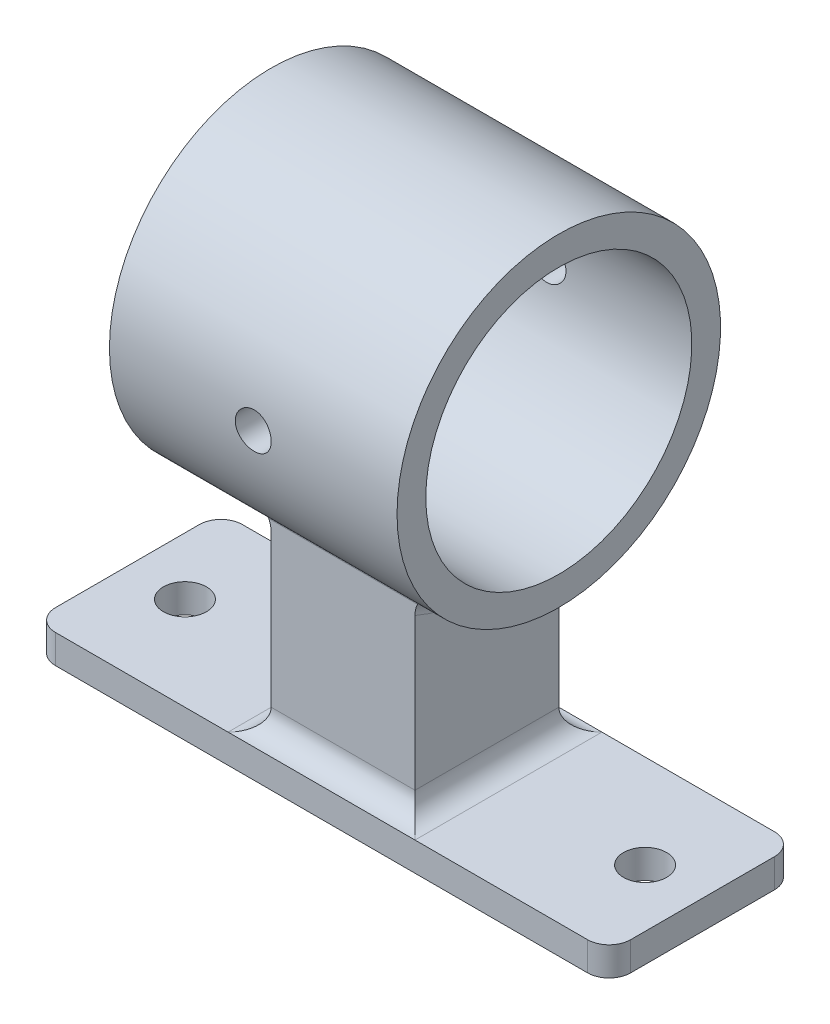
ISO-10303-21;
HEADER;
FILE_DESCRIPTION(('STEP AP214'),'2;1');
FILE_NAME('part.step','',(''),(''),'','','');
FILE_SCHEMA(('AUTOMOTIVE_DESIGN { 1 0 10303 214 1 1 1 1 }'));
ENDSEC;
DATA;
#1=APPLICATION_CONTEXT('core data for automotive mechanical design processes');
#2=APPLICATION_PROTOCOL_DEFINITION('international standard','automotive_design',2000,#1);
#3=PRODUCT_CONTEXT('',#1,'mechanical');
#4=PRODUCT('Part','Part','',(#3));
#5=PRODUCT_RELATED_PRODUCT_CATEGORY('part','',(#4));
#6=PRODUCT_DEFINITION_FORMATION('','',#4);
#7=PRODUCT_DEFINITION_CONTEXT('part definition',#1,'design');
#8=PRODUCT_DEFINITION('design','',#6,#7);
#9=PRODUCT_DEFINITION_SHAPE('','',#8);
#10=(LENGTH_UNIT() NAMED_UNIT(*) SI_UNIT(.MILLI.,.METRE.));
#11=(NAMED_UNIT(*) PLANE_ANGLE_UNIT() SI_UNIT($,.RADIAN.));
#12=(NAMED_UNIT(*) SI_UNIT($,.STERADIAN.) SOLID_ANGLE_UNIT());
#13=UNCERTAINTY_MEASURE_WITH_UNIT(LENGTH_MEASURE(1.E-05),#10,'distance_accuracy_value','');
#14=(GEOMETRIC_REPRESENTATION_CONTEXT(3) GLOBAL_UNCERTAINTY_ASSIGNED_CONTEXT((#13)) GLOBAL_UNIT_ASSIGNED_CONTEXT((#10,
#11,#12)) REPRESENTATION_CONTEXT('',''));
#15=CARTESIAN_POINT('',(0.,0.,0.));
#16=DIRECTION('',(0.,0.,1.));
#17=DIRECTION('',(1.,0.,0.));
#18=AXIS2_PLACEMENT_3D('',#15,#16,#17);
#19=CARTESIAN_POINT('',(77.,4.,-23.));
#20=DIRECTION('',(0.,-1.,0.));
#21=DIRECTION('',(0.,0.,-1.));
#22=AXIS2_PLACEMENT_3D('',#19,#20,#21);
#23=PLANE('',#22);
#24=CARTESIAN_POINT('',(72.,4.,-13.));
#25=DIRECTION('',(0.,1.,0.));
#26=DIRECTION('',(0.,0.,-1.));
#27=AXIS2_PLACEMENT_3D('',#24,#25,#26);
#28=CIRCLE('',#27,3.00000000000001);
#29=CARTESIAN_POINT('',(72.,4.,-16.));
#30=VERTEX_POINT('',#29);
#31=EDGE_CURVE('E388',#30,#30,#28,.T.);
#32=ORIENTED_EDGE('',*,*,#31,.F.);
#33=EDGE_LOOP('',(#32));
#34=FACE_BOUND('',#33,.T.);
#35=DIRECTION('',(-1.,0.,0.));
#36=VECTOR('',#35,1.);
#37=CARTESIAN_POINT('',(3.00000000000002,4.,-26.));
#38=LINE('',#37,#36);
#39=CARTESIAN_POINT('',(77.,4.,-26.));
#40=VERTEX_POINT('',#39);
#41=CARTESIAN_POINT('',(53.,4.,-26.));
#42=VERTEX_POINT('',#41);
#43=EDGE_CURVE('E176',#40,#42,#38,.T.);
#44=ORIENTED_EDGE('',*,*,#43,.T.);
#45=DIRECTION('',(0.,0.,-1.));
#46=VECTOR('',#45,1.);
#47=CARTESIAN_POINT('',(53.,4.,-3.));
#48=LINE('',#47,#46);
#49=CARTESIAN_POINT('',(53.,4.,0.));
#50=VERTEX_POINT('',#49);
#51=EDGE_CURVE('E237',#42,#50,#48,.F.);
#52=ORIENTED_EDGE('',*,*,#51,.T.);
#53=DIRECTION('',(1.,0.,0.));
#54=VECTOR('',#53,1.);
#55=CARTESIAN_POINT('',(3.00000000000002,4.,0.));
#56=LINE('',#55,#54);
#57=CARTESIAN_POINT('',(77.,4.,0.));
#58=VERTEX_POINT('',#57);
#59=EDGE_CURVE('E404',#50,#58,#56,.T.);
#60=ORIENTED_EDGE('',*,*,#59,.T.);
#61=CARTESIAN_POINT('',(77.,4.,-3.));
#62=DIRECTION('',(0.,1.,0.));
#63=DIRECTION('',(0.,0.,1.));
#64=AXIS2_PLACEMENT_3D('',#61,#62,#63);
#65=CIRCLE('',#64,3.);
#66=CARTESIAN_POINT('',(80.,4.,-3.00000000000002));
#67=VERTEX_POINT('',#66);
#68=EDGE_CURVE('E408',#58,#67,#65,.T.);
#69=ORIENTED_EDGE('',*,*,#68,.T.);
#70=DIRECTION('',(0.,0.,-1.));
#71=VECTOR('',#70,1.);
#72=CARTESIAN_POINT('',(80.,4.,-3.00000000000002));
#73=LINE('',#72,#71);
#74=CARTESIAN_POINT('',(80.,4.,-23.));
#75=VERTEX_POINT('',#74);
#76=EDGE_CURVE('E194',#67,#75,#73,.T.);
#77=ORIENTED_EDGE('',*,*,#76,.T.);
#78=CARTESIAN_POINT('',(77.,4.,-23.));
#79=DIRECTION('',(0.,1.,0.));
#80=DIRECTION('',(0.,0.,-1.));
#81=AXIS2_PLACEMENT_3D('',#78,#79,#80);
#82=CIRCLE('',#81,3.);
#83=EDGE_CURVE('E192',#75,#40,#82,.T.);
#84=ORIENTED_EDGE('',*,*,#83,.T.);
#85=EDGE_LOOP('',(#44,#52,#60,#69,#77,#84));
#86=FACE_BOUND('',#85,.T.);
#87=ADVANCED_FACE('F45',(#34,#86),#23,.F.);
#88=CARTESIAN_POINT('',(20.,51.5,-13.));
#89=DIRECTION('',(1.,0.,0.));
#90=DIRECTION('',(0.,0.,-1.));
#91=AXIS2_PLACEMENT_3D('',#88,#89,#90);
#92=CYLINDRICAL_SURFACE('',#91,22.5);
#93=CARTESIAN_POINT('',(42.5,51.5,-35.5));
#94=CARTESIAN_POINT('',(42.4999939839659,51.6399632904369,-35.4999982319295));
#95=CARTESIAN_POINT('',(42.4882065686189,51.7800170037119,-35.498680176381));
#96=CARTESIAN_POINT('',(42.4413655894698,52.0562355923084,-35.4935489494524));
#97=CARTESIAN_POINT('',(42.4062869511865,52.1923961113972,-35.4897330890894));
#98=CARTESIAN_POINT('',(42.3139025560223,52.4567888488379,-35.4800366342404));
#99=CARTESIAN_POINT('',(42.2566108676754,52.585026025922,-35.4741573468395));
#100=CARTESIAN_POINT('',(42.1214554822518,52.8300381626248,-35.4609899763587));
#101=CARTESIAN_POINT('',(42.0435956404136,52.9468152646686,-35.4537021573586));
#102=CARTESIAN_POINT('',(41.8691474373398,53.1661321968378,-35.438497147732));
#103=CARTESIAN_POINT('',(41.772486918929,53.2686144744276,-35.4305776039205));
#104=CARTESIAN_POINT('',(41.5633356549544,53.4559375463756,-35.4150209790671));
#105=CARTESIAN_POINT('',(41.4508441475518,53.5407774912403,-35.4073839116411));
#106=CARTESIAN_POINT('',(41.2128575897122,53.6906162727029,-35.3932333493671));
#107=CARTESIAN_POINT('',(41.0873290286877,53.7555621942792,-35.3867228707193));
#108=CARTESIAN_POINT('',(40.8270631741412,53.86343147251,-35.3755927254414));
#109=CARTESIAN_POINT('',(40.692326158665,53.9063554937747,-35.37097300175));
#110=CARTESIAN_POINT('',(40.4180600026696,53.9687899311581,-35.3641693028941));
#111=CARTESIAN_POINT('',(40.2785530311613,53.9883966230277,-35.3619753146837));
#112=CARTESIAN_POINT('',(39.9982126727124,54.0039375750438,-35.3602406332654));
#113=CARTESIAN_POINT('',(39.8573793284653,53.999872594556,-35.3606998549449));
#114=CARTESIAN_POINT('',(39.5790506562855,53.9682648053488,-35.3642105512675));
#115=CARTESIAN_POINT('',(39.4415431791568,53.9408275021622,-35.3672503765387));
#116=CARTESIAN_POINT('',(39.1730967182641,53.8634182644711,-35.3755615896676));
#117=CARTESIAN_POINT('',(39.0421578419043,53.8134459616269,-35.3808330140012));
#118=CARTESIAN_POINT('',(38.7902344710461,53.6922700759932,-35.3930268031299));
#119=CARTESIAN_POINT('',(38.6692724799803,53.6210200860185,-35.3999527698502));
#120=CARTESIAN_POINT('',(38.4409829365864,53.4593446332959,-35.4146723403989));
#121=CARTESIAN_POINT('',(38.3336558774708,53.3689184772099,-35.4224659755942));
#122=CARTESIAN_POINT('',(38.1350700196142,53.1708701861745,-35.4380946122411));
#123=CARTESIAN_POINT('',(38.0439019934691,53.0631570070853,-35.4459296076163));
#124=CARTESIAN_POINT('',(37.8809270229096,52.8339072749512,-35.4607182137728));
#125=CARTESIAN_POINT('',(37.8091201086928,52.7123707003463,-35.4676718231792));
#126=CARTESIAN_POINT('',(37.6869077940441,52.4588582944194,-35.479917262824));
#127=CARTESIAN_POINT('',(37.6365074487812,52.3268800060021,-35.4852087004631));
#128=CARTESIAN_POINT('',(37.5586077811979,52.0562621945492,-35.4935298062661));
#129=CARTESIAN_POINT('',(37.5311076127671,51.9176229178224,-35.4965595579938));
#130=CARTESIAN_POINT('',(37.4999051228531,51.6384041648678,-35.5000051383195));
#131=CARTESIAN_POINT('',(37.4960776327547,51.4978388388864,-35.5004347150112));
#132=CARTESIAN_POINT('',(37.5119997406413,51.2180687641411,-35.4986685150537));
#133=CARTESIAN_POINT('',(37.5317489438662,51.0788639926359,-35.4964727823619));
#134=CARTESIAN_POINT('',(37.5941599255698,50.8061311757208,-35.4897113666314));
#135=CARTESIAN_POINT('',(37.6367626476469,50.6725894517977,-35.4851517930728));
#136=CARTESIAN_POINT('',(37.7436103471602,50.4145471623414,-35.4741737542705));
#137=CARTESIAN_POINT('',(37.8078559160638,50.2900468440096,-35.4677552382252));
#138=CARTESIAN_POINT('',(37.9564728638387,50.0530584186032,-35.4537419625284));
#139=CARTESIAN_POINT('',(38.0409259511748,49.9406218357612,-35.4461424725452));
#140=CARTESIAN_POINT('',(38.227444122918,49.7314752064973,-35.4306339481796));
#141=CARTESIAN_POINT('',(38.3295097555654,49.6347656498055,-35.4227249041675));
#142=CARTESIAN_POINT('',(38.5489041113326,49.4593797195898,-35.407446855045));
#143=CARTESIAN_POINT('',(38.6662989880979,49.380785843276,-35.4000804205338));
#144=CARTESIAN_POINT('',(38.9126953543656,49.2444305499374,-35.386762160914));
#145=CARTESIAN_POINT('',(39.0416966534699,49.1866687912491,-35.3808103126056));
#146=CARTESIAN_POINT('',(39.3073680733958,49.0937535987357,-35.3710118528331));
#147=CARTESIAN_POINT('',(39.4440212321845,49.0585521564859,-35.3671607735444));
#148=CARTESIAN_POINT('',(39.7213439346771,49.011601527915,-35.361986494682));
#149=CARTESIAN_POINT('',(39.8620133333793,48.9998514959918,-35.3606632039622));
#150=CARTESIAN_POINT('',(40.1425551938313,49.000150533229,-35.3606965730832));
#151=CARTESIAN_POINT('',(40.2824278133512,49.0120700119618,-35.3620386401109));
#152=CARTESIAN_POINT('',(40.558169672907,49.059096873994,-35.3672202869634));
#153=CARTESIAN_POINT('',(40.6940389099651,49.0942042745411,-35.3710598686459));
#154=CARTESIAN_POINT('',(40.9579093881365,49.1865726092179,-35.3807996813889));
#155=CARTESIAN_POINT('',(41.0859123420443,49.2438287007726,-35.3866994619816));
#156=CARTESIAN_POINT('',(41.3305131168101,49.3788561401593,-35.3998957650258));
#157=CARTESIAN_POINT('',(41.4471109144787,49.456627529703,-35.4071922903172));
#158=CARTESIAN_POINT('',(41.666255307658,49.6309625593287,-35.4224078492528));
#159=CARTESIAN_POINT('',(41.7687247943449,49.727622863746,-35.4303299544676));
#160=CARTESIAN_POINT('',(41.9560423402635,49.9367947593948,-35.4458763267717));
#161=CARTESIAN_POINT('',(42.040886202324,50.0493101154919,-35.45350052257));
#162=CARTESIAN_POINT('',(42.1907554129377,50.2873818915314,-35.4676169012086));
#163=CARTESIAN_POINT('',(42.2557196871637,50.4129769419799,-35.4741055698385));
#164=CARTESIAN_POINT('',(42.3635468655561,50.6732893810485,-35.4851829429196));
#165=CARTESIAN_POINT('',(42.4064343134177,50.8079964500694,-35.4897737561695));
#166=CARTESIAN_POINT('',(42.4583739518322,51.0361997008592,-35.4954040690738));
#167=CARTESIAN_POINT('',(42.473961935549,51.1282448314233,-35.4971193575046));
#168=CARTESIAN_POINT('',(42.49477693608,51.3135132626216,-35.499417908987));
#169=CARTESIAN_POINT('',(42.5000040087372,51.4067365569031,-35.50000117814));
#170=CARTESIAN_POINT('',(42.5,51.5,-35.5));
#171=B_SPLINE_CURVE_WITH_KNOTS('',3,(#93,#94,#95,#96,#97,#98,#99,#100,#101,#102,#103,#104,#105,
#106,#107,#108,#109,#110,#111,#112,#113,#114,#115,#116,#117,#118,#119,#120,#121,#122,#123,#124,
#125,#126,#127,#128,#129,#130,#131,#132,#133,#134,#135,#136,#137,#138,#139,#140,#141,#142,#143,
#144,#145,#146,#147,#148,#149,#150,#151,#152,#153,#154,#155,#156,#157,#158,#159,#160,#161,#162,
#163,#164,#165,#166,#167,#168,#169,#170),.UNSPECIFIED.,.T.,.F.,(4,2,2,2,2,2,2,2,2,2,2,2,2,2,2,2,
2,2,2,2,2,2,2,2,2,2,2,2,2,2,2,2,2,2,2,2,2,2,4),(0.,0.419549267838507,0.839550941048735,
1.25928704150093,1.67894452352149,2.10024562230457,2.52156700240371,2.94399949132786,
3.36641923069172,3.78708870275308,4.20774468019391,4.62651176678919,5.04528569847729,
5.46497974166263,5.88468896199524,6.30668590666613,6.72868350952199,7.15078071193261,
7.57286231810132,7.99271025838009,8.4125511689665,8.83131234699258,9.25008497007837,
9.67058038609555,10.0910888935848,10.5134761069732,10.9358563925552,11.3573348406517,
11.7787980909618,12.1979601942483,12.6171226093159,13.0361934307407,13.4552651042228,
13.8765403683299,14.2979158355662,14.7205731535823,15.1427595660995,15.4223244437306,
15.7018878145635),.UNSPECIFIED.);
#172=CARTESIAN_POINT('',(42.5,51.5,-35.5));
#173=VERTEX_POINT('',#172);
#174=EDGE_CURVE('E305',#173,#173,#171,.T.);
#175=ORIENTED_EDGE('',*,*,#174,.T.);
#176=EDGE_LOOP('',(#175));
#177=FACE_BOUND('',#176,.T.);
#178=CARTESIAN_POINT('',(42.5,51.5,9.50000000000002));
#179=CARTESIAN_POINT('',(42.4999939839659,51.3600367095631,9.49999823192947));
#180=CARTESIAN_POINT('',(42.4882065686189,51.2199829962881,9.49868017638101));
#181=CARTESIAN_POINT('',(42.4413655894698,50.9437644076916,9.49354894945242));
#182=CARTESIAN_POINT('',(42.4062869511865,50.8076038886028,9.48973308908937));
#183=CARTESIAN_POINT('',(42.3139025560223,50.5432111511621,9.48003663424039));
#184=CARTESIAN_POINT('',(42.2566108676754,50.414973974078,9.47415734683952));
#185=CARTESIAN_POINT('',(42.1214554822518,50.1699618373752,9.46098997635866));
#186=CARTESIAN_POINT('',(42.0435956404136,50.0531847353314,9.45370215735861));
#187=CARTESIAN_POINT('',(41.8691474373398,49.8338678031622,9.43849714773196));
#188=CARTESIAN_POINT('',(41.772486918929,49.7313855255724,9.43057760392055));
#189=CARTESIAN_POINT('',(41.5633356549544,49.5440624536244,9.41502097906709));
#190=CARTESIAN_POINT('',(41.4508441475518,49.4592225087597,9.40738391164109));
#191=CARTESIAN_POINT('',(41.2128575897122,49.3093837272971,9.39323334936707));
#192=CARTESIAN_POINT('',(41.0873290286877,49.2444378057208,9.38672287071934));
#193=CARTESIAN_POINT('',(40.8270631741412,49.1365685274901,9.37559272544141));
#194=CARTESIAN_POINT('',(40.692326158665,49.0936445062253,9.37097300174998));
#195=CARTESIAN_POINT('',(40.4180600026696,49.031210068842,9.36416930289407));
#196=CARTESIAN_POINT('',(40.2785530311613,49.0116033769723,9.36197531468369));
#197=CARTESIAN_POINT('',(39.9982126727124,48.9960624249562,9.36024063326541));
#198=CARTESIAN_POINT('',(39.8573793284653,49.000127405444,9.36069985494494));
#199=CARTESIAN_POINT('',(39.5790506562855,49.0317351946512,9.36421055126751));
#200=CARTESIAN_POINT('',(39.4415431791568,49.0591724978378,9.36725037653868));
#201=CARTESIAN_POINT('',(39.1730967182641,49.1365817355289,9.37556158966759));
#202=CARTESIAN_POINT('',(39.0421578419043,49.1865540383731,9.38083301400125));
#203=CARTESIAN_POINT('',(38.7902344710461,49.3077299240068,9.39302680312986));
#204=CARTESIAN_POINT('',(38.6692724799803,49.3789799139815,9.39995276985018));
#205=CARTESIAN_POINT('',(38.4409829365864,49.5406553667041,9.41467234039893));
#206=CARTESIAN_POINT('',(38.3336558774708,49.6310815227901,9.42246597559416));
#207=CARTESIAN_POINT('',(38.1350700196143,49.8291298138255,9.43809461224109));
#208=CARTESIAN_POINT('',(38.0439019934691,49.9368429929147,9.44592960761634));
#209=CARTESIAN_POINT('',(37.8809270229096,50.1660927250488,9.46071821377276));
#210=CARTESIAN_POINT('',(37.8091201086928,50.2876292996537,9.46767182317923));
#211=CARTESIAN_POINT('',(37.6869077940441,50.5411417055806,9.47991726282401));
#212=CARTESIAN_POINT('',(37.6365074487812,50.6731199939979,9.48520870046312));
#213=CARTESIAN_POINT('',(37.5586077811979,50.9437378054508,9.49352980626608));
#214=CARTESIAN_POINT('',(37.5311076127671,51.0823770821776,9.49655955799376));
#215=CARTESIAN_POINT('',(37.4999051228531,51.3615958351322,9.50000513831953));
#216=CARTESIAN_POINT('',(37.4960776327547,51.5021611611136,9.50043471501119));
#217=CARTESIAN_POINT('',(37.5119997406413,51.781931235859,9.49866851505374));
#218=CARTESIAN_POINT('',(37.5317489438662,51.9211360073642,9.49647278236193));
#219=CARTESIAN_POINT('',(37.5941599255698,52.1938688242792,9.48971136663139));
#220=CARTESIAN_POINT('',(37.6367626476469,52.3274105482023,9.48515179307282));
#221=CARTESIAN_POINT('',(37.7436103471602,52.5854528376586,9.47417375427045));
#222=CARTESIAN_POINT('',(37.8078559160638,52.7099531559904,9.46775523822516));
#223=CARTESIAN_POINT('',(37.9564728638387,52.9469415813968,9.45374196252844));
#224=CARTESIAN_POINT('',(38.0409259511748,53.0593781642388,9.44614247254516));
#225=CARTESIAN_POINT('',(38.227444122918,53.2685247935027,9.4306339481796));
#226=CARTESIAN_POINT('',(38.3295097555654,53.3652343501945,9.4227249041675));
#227=CARTESIAN_POINT('',(38.5489041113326,53.5406202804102,9.40744685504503));
#228=CARTESIAN_POINT('',(38.6662989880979,53.619214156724,9.40008042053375));
#229=CARTESIAN_POINT('',(38.9126953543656,53.7555694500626,9.38676216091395));
#230=CARTESIAN_POINT('',(39.0416966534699,53.8133312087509,9.38081031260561));
#231=CARTESIAN_POINT('',(39.3073680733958,53.9062464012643,9.37101185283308));
#232=CARTESIAN_POINT('',(39.4440212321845,53.9414478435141,9.36716077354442));
#233=CARTESIAN_POINT('',(39.7213439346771,53.988398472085,9.36198649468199));
#234=CARTESIAN_POINT('',(39.8620133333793,54.0001485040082,9.36066320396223));
#235=CARTESIAN_POINT('',(40.1425551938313,53.999849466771,9.36069657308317));
#236=CARTESIAN_POINT('',(40.2824278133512,53.9879299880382,9.36203864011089));
#237=CARTESIAN_POINT('',(40.558169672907,53.940903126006,9.36722028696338));
#238=CARTESIAN_POINT('',(40.6940389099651,53.9057957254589,9.37105986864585));
#239=CARTESIAN_POINT('',(40.9579093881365,53.8134273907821,9.38079968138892));
#240=CARTESIAN_POINT('',(41.0859123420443,53.7561712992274,9.38669946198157));
#241=CARTESIAN_POINT('',(41.3305131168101,53.6211438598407,9.3998957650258));
#242=CARTESIAN_POINT('',(41.4471109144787,53.543372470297,9.40719229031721));
#243=CARTESIAN_POINT('',(41.666255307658,53.3690374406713,9.42240784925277));
#244=CARTESIAN_POINT('',(41.7687247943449,53.272377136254,9.43032995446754));
#245=CARTESIAN_POINT('',(41.9560423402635,53.0632052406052,9.44587632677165));
#246=CARTESIAN_POINT('',(42.040886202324,52.9506898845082,9.45350052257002));
#247=CARTESIAN_POINT('',(42.1907554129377,52.7126181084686,9.46761690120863));
#248=CARTESIAN_POINT('',(42.2557196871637,52.5870230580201,9.47410556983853));
#249=CARTESIAN_POINT('',(42.3635468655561,52.3267106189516,9.48518294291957));
#250=CARTESIAN_POINT('',(42.4064343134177,52.1920035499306,9.48977375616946));
#251=CARTESIAN_POINT('',(42.4583739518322,51.9638002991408,9.49540406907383));
#252=CARTESIAN_POINT('',(42.473961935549,51.8717551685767,9.4971193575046));
#253=CARTESIAN_POINT('',(42.49477693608,51.6864867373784,9.49941790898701));
#254=CARTESIAN_POINT('',(42.5000040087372,51.5932634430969,9.50000117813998));
#255=CARTESIAN_POINT('',(42.5,51.5,9.50000000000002));
#256=B_SPLINE_CURVE_WITH_KNOTS('',3,(#178,#179,#180,#181,#182,#183,#184,#185,#186,#187,#188,
#189,#190,#191,#192,#193,#194,#195,#196,#197,#198,#199,#200,#201,#202,#203,#204,#205,#206,#207,
#208,#209,#210,#211,#212,#213,#214,#215,#216,#217,#218,#219,#220,#221,#222,#223,#224,#225,#226,
#227,#228,#229,#230,#231,#232,#233,#234,#235,#236,#237,#238,#239,#240,#241,#242,#243,#244,#245,
#246,#247,#248,#249,#250,#251,#252,#253,#254,#255),.UNSPECIFIED.,.T.,.F.,(4,2,2,2,2,2,2,2,2,2,2,
2,2,2,2,2,2,2,2,2,2,2,2,2,2,2,2,2,2,2,2,2,2,2,2,2,2,2,4),(0.,0.4195492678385,0.839550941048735,
1.25928704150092,1.67894452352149,2.10024562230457,2.52156700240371,2.94399949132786,
3.36641923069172,3.78708870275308,4.20774468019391,4.62651176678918,5.04528569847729,
5.46497974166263,5.88468896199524,6.30668590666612,6.728683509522,7.1507807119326,
7.57286231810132,7.99271025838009,8.4125511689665,8.83131234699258,9.25008497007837,
9.67058038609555,10.0910888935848,10.5134761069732,10.9358563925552,11.3573348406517,
11.7787980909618,12.1979601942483,12.6171226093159,13.0361934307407,13.4552651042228,
13.8765403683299,14.2979158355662,14.7205731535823,15.1427595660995,15.4223244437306,
15.7018878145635),.UNSPECIFIED.);
#257=CARTESIAN_POINT('',(42.5,51.5,9.50000000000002));
#258=VERTEX_POINT('',#257);
#259=EDGE_CURVE('E331',#258,#258,#256,.T.);
#260=ORIENTED_EDGE('',*,*,#259,.T.);
#261=EDGE_LOOP('',(#260));
#262=FACE_BOUND('',#261,.T.);
#263=DIRECTION('',(1.,0.,0.));
#264=VECTOR('',#263,1.);
#265=CARTESIAN_POINT('',(20.,32.1434609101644,-1.52941176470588));
#266=LINE('',#265,#264);
#267=CARTESIAN_POINT('',(27.,32.1434609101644,-1.52941176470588));
#268=VERTEX_POINT('',#267);
#269=CARTESIAN_POINT('',(53.,32.1434609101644,-1.52941176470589));
#270=VERTEX_POINT('',#269);
#271=EDGE_CURVE('E214',#268,#270,#266,.T.);
#272=ORIENTED_EDGE('',*,*,#271,.T.);
#273=CARTESIAN_POINT('',(53.,51.5,-13.));
#274=DIRECTION('',(-1.,0.,0.));
#275=DIRECTION('',(0.,0.,1.));
#276=AXIS2_PLACEMENT_3D('',#273,#274,#275);
#277=CIRCLE('',#276,22.5);
#278=CARTESIAN_POINT('',(53.,32.1434609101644,-24.4705882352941));
#279=VERTEX_POINT('',#278);
#280=EDGE_CURVE('E216',#270,#279,#277,.F.);
#281=ORIENTED_EDGE('',*,*,#280,.T.);
#282=DIRECTION('',(1.,0.,0.));
#283=VECTOR('',#282,1.);
#284=CARTESIAN_POINT('',(20.,32.1434609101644,-24.4705882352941));
#285=LINE('',#284,#283);
#286=CARTESIAN_POINT('',(27.,32.1434609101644,-24.4705882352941));
#287=VERTEX_POINT('',#286);
#288=EDGE_CURVE('E203',#279,#287,#285,.F.);
#289=ORIENTED_EDGE('',*,*,#288,.T.);
#290=CARTESIAN_POINT('',(27.,51.5,-13.));
#291=DIRECTION('',(1.,0.,0.));
#292=DIRECTION('',(0.,0.,-1.));
#293=AXIS2_PLACEMENT_3D('',#290,#291,#292);
#294=CIRCLE('',#293,22.5);
#295=EDGE_CURVE('E206',#287,#268,#294,.F.);
#296=ORIENTED_EDGE('',*,*,#295,.T.);
#297=EDGE_LOOP('',(#272,#281,#289,#296));
#298=FACE_BOUND('',#297,.T.);
#299=CARTESIAN_POINT('',(60.,51.5,-13.));
#300=DIRECTION('',(-1.,0.,0.));
#301=DIRECTION('',(0.,0.,1.));
#302=AXIS2_PLACEMENT_3D('',#299,#300,#301);
#303=CIRCLE('',#302,22.5);
#304=CARTESIAN_POINT('',(60.,51.5,9.50000000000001));
#305=VERTEX_POINT('',#304);
#306=EDGE_CURVE('E485',#305,#305,#303,.T.);
#307=ORIENTED_EDGE('',*,*,#306,.T.);
#308=EDGE_LOOP('',(#307));
#309=FACE_BOUND('',#308,.T.);
#310=CARTESIAN_POINT('',(20.,51.5,-13.));
#311=DIRECTION('',(-1.,0.,0.));
#312=DIRECTION('',(0.,0.,1.));
#313=AXIS2_PLACEMENT_3D('',#310,#311,#312);
#314=CIRCLE('',#313,22.5);
#315=CARTESIAN_POINT('',(20.,51.5,9.50000000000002));
#316=VERTEX_POINT('',#315);
#317=EDGE_CURVE('E478',#316,#316,#314,.T.);
#318=ORIENTED_EDGE('',*,*,#317,.F.);
#319=EDGE_LOOP('',(#318));
#320=FACE_BOUND('',#319,.T.);
#321=ADVANCED_FACE('F339',(#177,#262,#298,#309,#320),#92,.T.);
#322=CARTESIAN_POINT('',(8.,4.,-13.));
#323=DIRECTION('',(0.,1.,0.));
#324=DIRECTION('',(0.,0.,1.));
#325=AXIS2_PLACEMENT_3D('',#322,#323,#324);
#326=CIRCLE('',#325,3.);
#327=CARTESIAN_POINT('',(8.,4.,-10.));
#328=VERTEX_POINT('',#327);
#329=EDGE_CURVE('E394',#328,#328,#326,.T.);
#330=ORIENTED_EDGE('',*,*,#329,.F.);
#331=EDGE_LOOP('',(#330));
#332=FACE_BOUND('',#331,.T.);
#333=CARTESIAN_POINT('',(3.00000000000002,4.,0.));
#334=VERTEX_POINT('',#333);
#335=CARTESIAN_POINT('',(27.,4.,0.));
#336=VERTEX_POINT('',#335);
#337=EDGE_CURVE('E405',#334,#336,#56,.T.);
#338=ORIENTED_EDGE('',*,*,#337,.T.);
#339=DIRECTION('',(0.,0.,1.));
#340=VECTOR('',#339,1.);
#341=CARTESIAN_POINT('',(27.,4.,-23.));
#342=LINE('',#341,#340);
#343=CARTESIAN_POINT('',(27.,4.,-26.));
#344=VERTEX_POINT('',#343);
#345=EDGE_CURVE('E235',#336,#344,#342,.F.);
#346=ORIENTED_EDGE('',*,*,#345,.T.);
#347=CARTESIAN_POINT('',(3.00000000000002,4.,-26.));
#348=VERTEX_POINT('',#347);
#349=EDGE_CURVE('E190',#344,#348,#38,.T.);
#350=ORIENTED_EDGE('',*,*,#349,.T.);
#351=CARTESIAN_POINT('',(3.,4.,-23.));
#352=DIRECTION('',(0.,1.,0.));
#353=DIRECTION('',(0.,0.,-1.));
#354=AXIS2_PLACEMENT_3D('',#351,#352,#353);
#355=CIRCLE('',#354,3.);
#356=CARTESIAN_POINT('',(0.,4.,-23.));
#357=VERTEX_POINT('',#356);
#358=EDGE_CURVE('E188',#348,#357,#355,.T.);
#359=ORIENTED_EDGE('',*,*,#358,.T.);
#360=DIRECTION('',(0.,0.,1.));
#361=VECTOR('',#360,1.);
#362=CARTESIAN_POINT('',(0.,4.,-3.00000000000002));
#363=LINE('',#362,#361);
#364=CARTESIAN_POINT('',(0.,4.,-3.00000000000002));
#365=VERTEX_POINT('',#364);
#366=EDGE_CURVE('E400',#357,#365,#363,.T.);
#367=ORIENTED_EDGE('',*,*,#366,.T.);
#368=CARTESIAN_POINT('',(3.,4.,-3.));
#369=DIRECTION('',(0.,1.,0.));
#370=DIRECTION('',(0.,0.,-1.));
#371=AXIS2_PLACEMENT_3D('',#368,#369,#370);
#372=CIRCLE('',#371,3.);
#373=EDGE_CURVE('E402',#365,#334,#372,.T.);
#374=ORIENTED_EDGE('',*,*,#373,.T.);
#375=EDGE_LOOP('',(#338,#346,#350,#359,#367,#374));
#376=FACE_BOUND('',#375,.T.);
#377=ADVANCED_FACE('F342',(#332,#376),#23,.F.);
#378=CARTESIAN_POINT('',(77.,0.,-23.));
#379=DIRECTION('',(0.,-1.,0.));
#380=DIRECTION('',(0.,0.,-1.));
#381=AXIS2_PLACEMENT_3D('',#378,#379,#380);
#382=PLANE('',#381);
#383=CARTESIAN_POINT('',(8.,0.,-13.));
#384=DIRECTION('',(0.,1.,0.));
#385=DIRECTION('',(0.,0.,1.));
#386=AXIS2_PLACEMENT_3D('',#383,#384,#385);
#387=CIRCLE('',#386,3.);
#388=CARTESIAN_POINT('',(8.,0.,-10.));
#389=VERTEX_POINT('',#388);
#390=EDGE_CURVE('E391',#389,#389,#387,.T.);
#391=ORIENTED_EDGE('',*,*,#390,.T.);
#392=EDGE_LOOP('',(#391));
#393=FACE_BOUND('',#392,.T.);
#394=CARTESIAN_POINT('',(77.,0.,-23.));
#395=DIRECTION('',(0.,1.,0.));
#396=DIRECTION('',(0.,0.,-1.));
#397=AXIS2_PLACEMENT_3D('',#394,#395,#396);
#398=CIRCLE('',#397,3.);
#399=CARTESIAN_POINT('',(80.,0.,-23.));
#400=VERTEX_POINT('',#399);
#401=CARTESIAN_POINT('',(77.,0.,-26.));
#402=VERTEX_POINT('',#401);
#403=EDGE_CURVE('E202',#400,#402,#398,.T.);
#404=ORIENTED_EDGE('',*,*,#403,.F.);
#405=DIRECTION('',(0.,0.,-1.));
#406=VECTOR('',#405,1.);
#407=CARTESIAN_POINT('',(80.,0.,-3.00000000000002));
#408=LINE('',#407,#406);
#409=CARTESIAN_POINT('',(80.,0.,-3.00000000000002));
#410=VERTEX_POINT('',#409);
#411=EDGE_CURVE('E198',#410,#400,#408,.T.);
#412=ORIENTED_EDGE('',*,*,#411,.F.);
#413=CARTESIAN_POINT('',(77.,0.,-3.));
#414=DIRECTION('',(0.,1.,0.));
#415=DIRECTION('',(0.,0.,1.));
#416=AXIS2_PLACEMENT_3D('',#413,#414,#415);
#417=CIRCLE('',#416,3.);
#418=CARTESIAN_POINT('',(77.,0.,0.));
#419=VERTEX_POINT('',#418);
#420=EDGE_CURVE('E424',#419,#410,#417,.T.);
#421=ORIENTED_EDGE('',*,*,#420,.F.);
#422=DIRECTION('',(1.,0.,0.));
#423=VECTOR('',#422,1.);
#424=CARTESIAN_POINT('',(3.00000000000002,0.,0.));
#425=LINE('',#424,#423);
#426=CARTESIAN_POINT('',(3.00000000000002,0.,0.));
#427=VERTEX_POINT('',#426);
#428=EDGE_CURVE('E422',#427,#419,#425,.T.);
#429=ORIENTED_EDGE('',*,*,#428,.F.);
#430=CARTESIAN_POINT('',(3.,0.,-3.));
#431=DIRECTION('',(0.,1.,0.));
#432=DIRECTION('',(0.,0.,-1.));
#433=AXIS2_PLACEMENT_3D('',#430,#431,#432);
#434=CIRCLE('',#433,3.);
#435=CARTESIAN_POINT('',(0.,0.,-3.00000000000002));
#436=VERTEX_POINT('',#435);
#437=EDGE_CURVE('E420',#436,#427,#434,.T.);
#438=ORIENTED_EDGE('',*,*,#437,.F.);
#439=DIRECTION('',(0.,0.,1.));
#440=VECTOR('',#439,1.);
#441=CARTESIAN_POINT('',(0.,0.,-3.00000000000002));
#442=LINE('',#441,#440);
#443=CARTESIAN_POINT('',(0.,0.,-23.));
#444=VERTEX_POINT('',#443);
#445=EDGE_CURVE('E418',#444,#436,#442,.T.);
#446=ORIENTED_EDGE('',*,*,#445,.F.);
#447=CARTESIAN_POINT('',(3.,0.,-23.));
#448=DIRECTION('',(0.,1.,0.));
#449=DIRECTION('',(0.,0.,-1.));
#450=AXIS2_PLACEMENT_3D('',#447,#448,#449);
#451=CIRCLE('',#450,3.);
#452=CARTESIAN_POINT('',(3.00000000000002,0.,-26.));
#453=VERTEX_POINT('',#452);
#454=EDGE_CURVE('E416',#453,#444,#451,.T.);
#455=ORIENTED_EDGE('',*,*,#454,.F.);
#456=DIRECTION('',(-1.,0.,0.));
#457=VECTOR('',#456,1.);
#458=CARTESIAN_POINT('',(3.00000000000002,0.,-26.));
#459=LINE('',#458,#457);
#460=EDGE_CURVE('E414',#402,#453,#459,.T.);
#461=ORIENTED_EDGE('',*,*,#460,.F.);
#462=EDGE_LOOP('',(#404,#412,#421,#429,#438,#446,#455,#461));
#463=FACE_BOUND('',#462,.T.);
#464=CARTESIAN_POINT('',(72.,0.,-13.));
#465=DIRECTION('',(0.,1.,0.));
#466=DIRECTION('',(0.,0.,-1.));
#467=AXIS2_PLACEMENT_3D('',#464,#465,#466);
#468=CIRCLE('',#467,3.00000000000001);
#469=CARTESIAN_POINT('',(72.,0.,-16.));
#470=VERTEX_POINT('',#469);
#471=EDGE_CURVE('E383',#470,#470,#468,.T.);
#472=ORIENTED_EDGE('',*,*,#471,.T.);
#473=EDGE_LOOP('',(#472));
#474=FACE_BOUND('',#473,.T.);
#475=ADVANCED_FACE('F451',(#393,#463,#474),#382,.T.);
#476=CARTESIAN_POINT('',(77.,4.,-23.));
#477=DIRECTION('',(0.,-1.,0.));
#478=DIRECTION('',(0.,0.,-1.));
#479=AXIS2_PLACEMENT_3D('',#476,#477,#478);
#480=CYLINDRICAL_SURFACE('',#479,3.);
#481=ORIENTED_EDGE('',*,*,#403,.T.);
#482=DIRECTION('',(0.,-1.,0.));
#483=VECTOR('',#482,1.);
#484=CARTESIAN_POINT('',(77.,4.,-26.));
#485=LINE('',#484,#483);
#486=EDGE_CURVE('E180',#40,#402,#485,.T.);
#487=ORIENTED_EDGE('',*,*,#486,.F.);
#488=ORIENTED_EDGE('',*,*,#83,.F.);
#489=DIRECTION('',(0.,-1.,0.));
#490=VECTOR('',#489,1.);
#491=CARTESIAN_POINT('',(80.,4.,-23.));
#492=LINE('',#491,#490);
#493=EDGE_CURVE('E412',#75,#400,#492,.T.);
#494=ORIENTED_EDGE('',*,*,#493,.T.);
#495=EDGE_LOOP('',(#481,#487,#488,#494));
#496=FACE_BOUND('',#495,.T.);
#497=ADVANCED_FACE('F200',(#496),#480,.T.);
#498=CARTESIAN_POINT('',(3.00000000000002,4.,-26.));
#499=DIRECTION('',(0.,0.,1.));
#500=DIRECTION('',(1.,0.,0.));
#501=AXIS2_PLACEMENT_3D('',#498,#499,#500);
#502=PLANE('',#501);
#503=ORIENTED_EDGE('',*,*,#460,.T.);
#504=DIRECTION('',(0.,-1.,0.));
#505=VECTOR('',#504,1.);
#506=CARTESIAN_POINT('',(3.00000000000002,4.,-26.));
#507=LINE('',#506,#505);
#508=EDGE_CURVE('E204',#348,#453,#507,.T.);
#509=ORIENTED_EDGE('',*,*,#508,.F.);
#510=ORIENTED_EDGE('',*,*,#349,.F.);
#511=EDGE_CURVE('E184',#42,#344,#38,.T.);
#512=ORIENTED_EDGE('',*,*,#511,.F.);
#513=ORIENTED_EDGE('',*,*,#43,.F.);
#514=ORIENTED_EDGE('',*,*,#486,.T.);
#515=EDGE_LOOP('',(#503,#509,#510,#512,#513,#514));
#516=FACE_BOUND('',#515,.T.);
#517=ADVANCED_FACE('F178',(#516),#502,.F.);
#518=CARTESIAN_POINT('',(3.,4.,-23.));
#519=DIRECTION('',(0.,-1.,0.));
#520=DIRECTION('',(0.,0.,-1.));
#521=AXIS2_PLACEMENT_3D('',#518,#519,#520);
#522=CYLINDRICAL_SURFACE('',#521,3.);
#523=ORIENTED_EDGE('',*,*,#454,.T.);
#524=DIRECTION('',(0.,-1.,0.));
#525=VECTOR('',#524,1.);
#526=CARTESIAN_POINT('',(0.,4.,-23.));
#527=LINE('',#526,#525);
#528=EDGE_CURVE('E209',#357,#444,#527,.T.);
#529=ORIENTED_EDGE('',*,*,#528,.F.);
#530=ORIENTED_EDGE('',*,*,#358,.F.);
#531=ORIENTED_EDGE('',*,*,#508,.T.);
#532=EDGE_LOOP('',(#523,#529,#530,#531));
#533=FACE_BOUND('',#532,.T.);
#534=ADVANCED_FACE('F582',(#533),#522,.T.);
#535=CARTESIAN_POINT('',(0.,4.,-3.00000000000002));
#536=DIRECTION('',(1.,0.,0.));
#537=DIRECTION('',(0.,0.,-1.));
#538=AXIS2_PLACEMENT_3D('',#535,#536,#537);
#539=PLANE('',#538);
#540=ORIENTED_EDGE('',*,*,#445,.T.);
#541=DIRECTION('',(0.,-1.,0.));
#542=VECTOR('',#541,1.);
#543=CARTESIAN_POINT('',(0.,4.,-3.00000000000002));
#544=LINE('',#543,#542);
#545=EDGE_CURVE('E437',#365,#436,#544,.T.);
#546=ORIENTED_EDGE('',*,*,#545,.F.);
#547=ORIENTED_EDGE('',*,*,#366,.F.);
#548=ORIENTED_EDGE('',*,*,#528,.T.);
#549=EDGE_LOOP('',(#540,#546,#547,#548));
#550=FACE_BOUND('',#549,.T.);
#551=ADVANCED_FACE('F444',(#550),#539,.F.);
#552=CARTESIAN_POINT('',(3.,4.,-3.));
#553=DIRECTION('',(0.,-1.,0.));
#554=DIRECTION('',(0.,0.,-1.));
#555=AXIS2_PLACEMENT_3D('',#552,#553,#554);
#556=CYLINDRICAL_SURFACE('',#555,3.);
#557=ORIENTED_EDGE('',*,*,#437,.T.);
#558=DIRECTION('',(0.,-1.,0.));
#559=VECTOR('',#558,1.);
#560=CARTESIAN_POINT('',(3.00000000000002,4.,0.));
#561=LINE('',#560,#559);
#562=EDGE_CURVE('E434',#334,#427,#561,.T.);
#563=ORIENTED_EDGE('',*,*,#562,.F.);
#564=ORIENTED_EDGE('',*,*,#373,.F.);
#565=ORIENTED_EDGE('',*,*,#545,.T.);
#566=EDGE_LOOP('',(#557,#563,#564,#565));
#567=FACE_BOUND('',#566,.T.);
#568=ADVANCED_FACE('F457',(#567),#556,.T.);
#569=CARTESIAN_POINT('',(3.00000000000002,4.,0.));
#570=DIRECTION('',(0.,0.,-1.));
#571=DIRECTION('',(-1.,0.,0.));
#572=AXIS2_PLACEMENT_3D('',#569,#570,#571);
#573=PLANE('',#572);
#574=ORIENTED_EDGE('',*,*,#428,.T.);
#575=DIRECTION('',(0.,-1.,0.));
#576=VECTOR('',#575,1.);
#577=CARTESIAN_POINT('',(77.,4.,0.));
#578=LINE('',#577,#576);
#579=EDGE_CURVE('E431',#58,#419,#578,.T.);
#580=ORIENTED_EDGE('',*,*,#579,.F.);
#581=ORIENTED_EDGE('',*,*,#59,.F.);
#582=EDGE_CURVE('E409',#336,#50,#56,.T.);
#583=ORIENTED_EDGE('',*,*,#582,.F.);
#584=ORIENTED_EDGE('',*,*,#337,.F.);
#585=ORIENTED_EDGE('',*,*,#562,.T.);
#586=EDGE_LOOP('',(#574,#580,#581,#583,#584,#585));
#587=FACE_BOUND('',#586,.T.);
#588=ADVANCED_FACE('F461',(#587),#573,.F.);
#589=CARTESIAN_POINT('',(77.,4.,-3.));
#590=DIRECTION('',(0.,-1.,0.));
#591=DIRECTION('',(0.,0.,-1.));
#592=AXIS2_PLACEMENT_3D('',#589,#590,#591);
#593=CYLINDRICAL_SURFACE('',#592,3.);
#594=ORIENTED_EDGE('',*,*,#420,.T.);
#595=DIRECTION('',(0.,-1.,0.));
#596=VECTOR('',#595,1.);
#597=CARTESIAN_POINT('',(80.,4.,-3.00000000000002));
#598=LINE('',#597,#596);
#599=EDGE_CURVE('E428',#67,#410,#598,.T.);
#600=ORIENTED_EDGE('',*,*,#599,.F.);
#601=ORIENTED_EDGE('',*,*,#68,.F.);
#602=ORIENTED_EDGE('',*,*,#579,.T.);
#603=EDGE_LOOP('',(#594,#600,#601,#602));
#604=FACE_BOUND('',#603,.T.);
#605=ADVANCED_FACE('F529',(#604),#593,.T.);
#606=CARTESIAN_POINT('',(80.,4.,-3.00000000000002));
#607=DIRECTION('',(-1.,0.,0.));
#608=DIRECTION('',(0.,0.,1.));
#609=AXIS2_PLACEMENT_3D('',#606,#607,#608);
#610=PLANE('',#609);
#611=ORIENTED_EDGE('',*,*,#411,.T.);
#612=ORIENTED_EDGE('',*,*,#493,.F.);
#613=ORIENTED_EDGE('',*,*,#76,.F.);
#614=ORIENTED_EDGE('',*,*,#599,.T.);
#615=EDGE_LOOP('',(#611,#612,#613,#614));
#616=FACE_BOUND('',#615,.T.);
#617=ADVANCED_FACE('F521',(#616),#610,.F.);
#618=CARTESIAN_POINT('',(8.,4.,-13.));
#619=DIRECTION('',(0.,-1.,0.));
#620=DIRECTION('',(0.,0.,-1.));
#621=AXIS2_PLACEMENT_3D('',#618,#619,#620);
#622=CYLINDRICAL_SURFACE('',#621,3.);
#623=ORIENTED_EDGE('',*,*,#329,.T.);
#624=EDGE_LOOP('',(#623));
#625=FACE_BOUND('',#624,.T.);
#626=ORIENTED_EDGE('',*,*,#390,.F.);
#627=EDGE_LOOP('',(#626));
#628=FACE_BOUND('',#627,.T.);
#629=ADVANCED_FACE('F517',(#625,#628),#622,.F.);
#630=CARTESIAN_POINT('',(72.,4.,-13.));
#631=DIRECTION('',(0.,-1.,0.));
#632=DIRECTION('',(0.,0.,-1.));
#633=AXIS2_PLACEMENT_3D('',#630,#631,#632);
#634=CYLINDRICAL_SURFACE('',#633,3.00000000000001);
#635=ORIENTED_EDGE('',*,*,#31,.T.);
#636=EDGE_LOOP('',(#635));
#637=FACE_BOUND('',#636,.T.);
#638=ORIENTED_EDGE('',*,*,#471,.F.);
#639=EDGE_LOOP('',(#638));
#640=FACE_BOUND('',#639,.T.);
#641=ADVANCED_FACE('F520',(#637,#640),#634,.F.);
#642=CARTESIAN_POINT('',(50.,29.,-23.));
#643=DIRECTION('',(-1.,0.,0.));
#644=DIRECTION('',(0.,0.,1.));
#645=AXIS2_PLACEMENT_3D('',#642,#643,#644);
#646=PLANE('',#645);
#647=DIRECTION('',(0.,-1.,0.));
#648=VECTOR('',#647,1.);
#649=CARTESIAN_POINT('',(50.,29.,-23.));
#650=LINE('',#649,#648);
#651=CARTESIAN_POINT('',(50.,28.0425917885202,-23.));
#652=VERTEX_POINT('',#651);
#653=CARTESIAN_POINT('',(50.,7.,-23.));
#654=VERTEX_POINT('',#653);
#655=EDGE_CURVE('E381',#652,#654,#650,.T.);
#656=ORIENTED_EDGE('',*,*,#655,.F.);
#657=CARTESIAN_POINT('',(50.,51.5,-13.));
#658=DIRECTION('',(-1.,0.,0.));
#659=DIRECTION('',(0.,0.,1.));
#660=AXIS2_PLACEMENT_3D('',#657,#658,#659);
#661=CIRCLE('',#660,25.5);
#662=CARTESIAN_POINT('',(50.,28.0425917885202,-3.));
#663=VERTEX_POINT('',#662);
#664=EDGE_CURVE('E222',#652,#663,#661,.T.);
#665=ORIENTED_EDGE('',*,*,#664,.T.);
#666=DIRECTION('',(0.,-1.,0.));
#667=VECTOR('',#666,1.);
#668=CARTESIAN_POINT('',(50.,29.,-3.));
#669=LINE('',#668,#667);
#670=CARTESIAN_POINT('',(50.,7.,-3.));
#671=VERTEX_POINT('',#670);
#672=EDGE_CURVE('E361',#663,#671,#669,.T.);
#673=ORIENTED_EDGE('',*,*,#672,.T.);
#674=DIRECTION('',(0.,0.,-1.));
#675=VECTOR('',#674,1.);
#676=CARTESIAN_POINT('',(50.,7.,-23.));
#677=LINE('',#676,#675);
#678=EDGE_CURVE('E219',#671,#654,#677,.T.);
#679=ORIENTED_EDGE('',*,*,#678,.T.);
#680=EDGE_LOOP('',(#656,#665,#673,#679));
#681=FACE_BOUND('',#680,.T.);
#682=ADVANCED_FACE('F477',(#681),#646,.F.);
#683=CARTESIAN_POINT('',(30.,29.,-23.));
#684=DIRECTION('',(0.,0.,1.));
#685=DIRECTION('',(1.,0.,0.));
#686=AXIS2_PLACEMENT_3D('',#683,#684,#685);
#687=PLANE('',#686);
#688=CARTESIAN_POINT('',(30.,28.0425917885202,-23.));
#689=CARTESIAN_POINT('',(30.0000051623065,28.1428707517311,-23.));
#690=CARTESIAN_POINT('',(29.9957455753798,28.2431488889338,-23.));
#691=CARTESIAN_POINT('',(29.9787789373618,28.4430468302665,-23.));
#692=CARTESIAN_POINT('',(29.966066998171,28.5426662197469,-23.));
#693=CARTESIAN_POINT('',(29.9325880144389,28.7386566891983,-23.));
#694=CARTESIAN_POINT('',(29.9119731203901,28.8350538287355,-23.));
#695=CARTESIAN_POINT('',(29.8628046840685,29.0257485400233,-23.));
#696=CARTESIAN_POINT('',(29.8342561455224,29.1200473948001,-23.));
#697=CARTESIAN_POINT('',(29.7810912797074,29.2723042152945,-23.));
#698=CARTESIAN_POINT('',(29.7587831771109,29.3310782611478,-23.));
#699=CARTESIAN_POINT('',(29.7108842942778,29.4476822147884,-23.));
#700=CARTESIAN_POINT('',(29.6852747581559,29.5055044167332,-23.));
#701=CARTESIAN_POINT('',(29.6580955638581,29.5625890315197,-23.));
#702=B_SPLINE_CURVE_WITH_KNOTS('',3,(#688,#689,#690,#691,#692,#693,#694,#695,#696,#697,#698,
#699,#700,#701),.UNSPECIFIED.,.F.,.F.,(4,2,2,2,2,2,4),(0.,0.300746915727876,0.601667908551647,
0.897064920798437,1.19227604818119,1.38078722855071,1.57042090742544),.UNSPECIFIED.);
#703=CARTESIAN_POINT('',(30.,28.0425917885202,-23.));
#704=VERTEX_POINT('',#703);
#705=CARTESIAN_POINT('',(29.6580955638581,29.5625890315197,-23.));
#706=VERTEX_POINT('',#705);
#707=EDGE_CURVE('E12',#704,#706,#702,.T.);
#708=ORIENTED_EDGE('',*,*,#707,.T.);
#709=DIRECTION('',(-1.,0.,0.));
#710=VECTOR('',#709,1.);
#711=CARTESIAN_POINT('',(50.,29.5625890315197,-23.));
#712=LINE('',#711,#710);
#713=CARTESIAN_POINT('',(50.341904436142,29.5625890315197,-23.));
#714=VERTEX_POINT('',#713);
#715=EDGE_CURVE('E66',#706,#714,#712,.F.);
#716=ORIENTED_EDGE('',*,*,#715,.T.);
#717=CARTESIAN_POINT('',(50.341904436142,29.5625890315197,-23.));
#718=CARTESIAN_POINT('',(50.2987806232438,29.4720256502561,-23.));
#719=CARTESIAN_POINT('',(50.2596098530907,29.3795917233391,-23.));
#720=CARTESIAN_POINT('',(50.1893285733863,29.1917055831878,-23.));
#721=CARTESIAN_POINT('',(50.1582181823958,29.0962533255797,-23.));
#722=CARTESIAN_POINT('',(50.1047037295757,28.9048111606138,-23.));
#723=CARTESIAN_POINT('',(50.0821517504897,28.8088625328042,-23.));
#724=CARTESIAN_POINT('',(50.0450861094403,28.6154490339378,-23.));
#725=CARTESIAN_POINT('',(50.0305708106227,28.5179844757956,-23.));
#726=CARTESIAN_POINT('',(50.0067277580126,28.2947432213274,-23.));
#727=CARTESIAN_POINT('',(49.9999929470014,28.1686851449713,-23.));
#728=CARTESIAN_POINT('',(50.,28.0425917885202,-23.));
#729=B_SPLINE_CURVE_WITH_KNOTS('',3,(#717,#718,#719,#720,#721,#722,#723,#724,#725,#726,#727,
#728),.UNSPECIFIED.,.F.,.F.,(4,2,2,2,2,4),(0.,0.300809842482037,0.601624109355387,
0.896972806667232,1.19226132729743,1.57028452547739),.UNSPECIFIED.);
#730=EDGE_CURVE('E239',#714,#652,#729,.T.);
#731=ORIENTED_EDGE('',*,*,#730,.T.);
#732=ORIENTED_EDGE('',*,*,#655,.T.);
#733=DIRECTION('',(-1.,0.,0.));
#734=VECTOR('',#733,1.);
#735=CARTESIAN_POINT('',(30.,7.,-23.));
#736=LINE('',#735,#734);
#737=CARTESIAN_POINT('',(30.,7.,-23.));
#738=VERTEX_POINT('',#737);
#739=EDGE_CURVE('E232',#654,#738,#736,.T.);
#740=ORIENTED_EDGE('',*,*,#739,.T.);
#741=DIRECTION('',(0.,-1.,0.));
#742=VECTOR('',#741,1.);
#743=CARTESIAN_POINT('',(30.,29.,-23.));
#744=LINE('',#743,#742);
#745=EDGE_CURVE('E375',#704,#738,#744,.T.);
#746=ORIENTED_EDGE('',*,*,#745,.F.);
#747=EDGE_LOOP('',(#708,#716,#731,#732,#740,#746));
#748=FACE_BOUND('',#747,.T.);
#749=ADVANCED_FACE('F252',(#748),#687,.F.);
#750=CARTESIAN_POINT('',(30.,29.,-23.));
#751=DIRECTION('',(1.,0.,0.));
#752=DIRECTION('',(0.,0.,-1.));
#753=AXIS2_PLACEMENT_3D('',#750,#751,#752);
#754=PLANE('',#753);
#755=DIRECTION('',(0.,-1.,0.));
#756=VECTOR('',#755,1.);
#757=CARTESIAN_POINT('',(30.,29.,-3.));
#758=LINE('',#757,#756);
#759=CARTESIAN_POINT('',(30.,28.0425917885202,-3.));
#760=VERTEX_POINT('',#759);
#761=CARTESIAN_POINT('',(30.,7.,-3.));
#762=VERTEX_POINT('',#761);
#763=EDGE_CURVE('E377',#760,#762,#758,.T.);
#764=ORIENTED_EDGE('',*,*,#763,.F.);
#765=CARTESIAN_POINT('',(30.,51.5,-13.));
#766=DIRECTION('',(1.,0.,0.));
#767=DIRECTION('',(0.,0.,-1.));
#768=AXIS2_PLACEMENT_3D('',#765,#766,#767);
#769=CIRCLE('',#768,25.5);
#770=EDGE_CURVE('E230',#760,#704,#769,.T.);
#771=ORIENTED_EDGE('',*,*,#770,.T.);
#772=ORIENTED_EDGE('',*,*,#745,.T.);
#773=DIRECTION('',(0.,0.,1.));
#774=VECTOR('',#773,1.);
#775=CARTESIAN_POINT('',(30.,7.,-3.));
#776=LINE('',#775,#774);
#777=EDGE_CURVE('E228',#738,#762,#776,.T.);
#778=ORIENTED_EDGE('',*,*,#777,.T.);
#779=EDGE_LOOP('',(#764,#771,#772,#778));
#780=FACE_BOUND('',#779,.T.);
#781=ADVANCED_FACE('F349',(#780),#754,.F.);
#782=CARTESIAN_POINT('',(30.,29.,-3.));
#783=DIRECTION('',(0.,0.,-1.));
#784=DIRECTION('',(-1.,0.,0.));
#785=AXIS2_PLACEMENT_3D('',#782,#783,#784);
#786=PLANE('',#785);
#787=CARTESIAN_POINT('',(50.,28.0425917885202,-3.));
#788=CARTESIAN_POINT('',(49.9999948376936,28.1428707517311,-3.));
#789=CARTESIAN_POINT('',(50.0042544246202,28.2431488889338,-3.));
#790=CARTESIAN_POINT('',(50.0212210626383,28.4430468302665,-3.));
#791=CARTESIAN_POINT('',(50.0339330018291,28.5426662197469,-3.));
#792=CARTESIAN_POINT('',(50.0674119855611,28.7386566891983,-3.));
#793=CARTESIAN_POINT('',(50.0880268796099,28.8350538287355,-3.));
#794=CARTESIAN_POINT('',(50.1371953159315,29.0257485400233,-3.));
#795=CARTESIAN_POINT('',(50.1657438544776,29.1200473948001,-3.));
#796=CARTESIAN_POINT('',(50.2189087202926,29.2723042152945,-3.));
#797=CARTESIAN_POINT('',(50.2412168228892,29.3310782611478,-3.));
#798=CARTESIAN_POINT('',(50.2891157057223,29.4476822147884,-3.));
#799=CARTESIAN_POINT('',(50.3147252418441,29.5055044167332,-3.));
#800=CARTESIAN_POINT('',(50.341904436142,29.5625890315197,-3.));
#801=B_SPLINE_CURVE_WITH_KNOTS('',3,(#787,#788,#789,#790,#791,#792,#793,#794,#795,#796,#797,
#798,#799,#800),.UNSPECIFIED.,.F.,.F.,(4,2,2,2,2,2,4),(0.,0.300746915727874,0.601667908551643,
0.897064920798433,1.19227604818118,1.3807872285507,1.57042090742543),.UNSPECIFIED.);
#802=CARTESIAN_POINT('',(50.341904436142,29.5625890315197,-3.));
#803=VERTEX_POINT('',#802);
#804=EDGE_CURVE('E246',#663,#803,#801,.T.);
#805=ORIENTED_EDGE('',*,*,#804,.T.);
#806=DIRECTION('',(-1.,0.,0.));
#807=VECTOR('',#806,1.);
#808=CARTESIAN_POINT('',(30.,29.5625890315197,-3.));
#809=LINE('',#808,#807);
#810=CARTESIAN_POINT('',(29.6580955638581,29.5625890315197,-3.));
#811=VERTEX_POINT('',#810);
#812=EDGE_CURVE('E73',#803,#811,#809,.T.);
#813=ORIENTED_EDGE('',*,*,#812,.T.);
#814=CARTESIAN_POINT('',(29.6580955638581,29.5625890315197,-3.));
#815=CARTESIAN_POINT('',(29.7012193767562,29.4720256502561,-3.));
#816=CARTESIAN_POINT('',(29.7403901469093,29.3795917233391,-3.));
#817=CARTESIAN_POINT('',(29.8106714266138,29.1917055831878,-3.));
#818=CARTESIAN_POINT('',(29.8417818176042,29.0962533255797,-3.));
#819=CARTESIAN_POINT('',(29.8952962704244,28.9048111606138,-3.));
#820=CARTESIAN_POINT('',(29.9178482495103,28.8088625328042,-3.));
#821=CARTESIAN_POINT('',(29.9549138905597,28.6154490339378,-3.));
#822=CARTESIAN_POINT('',(29.9694291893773,28.5179844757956,-3.));
#823=CARTESIAN_POINT('',(29.9932722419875,28.2947432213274,-3.));
#824=CARTESIAN_POINT('',(30.0000070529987,28.1686851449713,-3.));
#825=CARTESIAN_POINT('',(30.,28.0425917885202,-3.));
#826=B_SPLINE_CURVE_WITH_KNOTS('',3,(#814,#815,#816,#817,#818,#819,#820,#821,#822,#823,#824,
#825),.UNSPECIFIED.,.F.,.F.,(4,2,2,2,2,4),(0.,0.300809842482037,0.601624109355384,
0.896972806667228,1.19226132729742,1.57028452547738),.UNSPECIFIED.);
#827=EDGE_CURVE('E58',#811,#760,#826,.T.);
#828=ORIENTED_EDGE('',*,*,#827,.T.);
#829=ORIENTED_EDGE('',*,*,#763,.T.);
#830=DIRECTION('',(1.,0.,0.));
#831=VECTOR('',#830,1.);
#832=CARTESIAN_POINT('',(50.,7.,-3.));
#833=LINE('',#832,#831);
#834=EDGE_CURVE('E225',#762,#671,#833,.T.);
#835=ORIENTED_EDGE('',*,*,#834,.T.);
#836=ORIENTED_EDGE('',*,*,#672,.F.);
#837=EDGE_LOOP('',(#805,#813,#828,#829,#835,#836));
#838=FACE_BOUND('',#837,.T.);
#839=ADVANCED_FACE('F345',(#838),#786,.F.);
#840=CARTESIAN_POINT('',(20.,51.5,-13.));
#841=DIRECTION('',(-1.,0.,0.));
#842=DIRECTION('',(0.,0.,1.));
#843=AXIS2_PLACEMENT_3D('',#840,#841,#842);
#844=PLANE('',#843);
#845=ORIENTED_EDGE('',*,*,#317,.T.);
#846=EDGE_LOOP('',(#845));
#847=FACE_BOUND('',#846,.T.);
#848=CARTESIAN_POINT('',(20.,51.5,-13.));
#849=DIRECTION('',(-1.,0.,0.));
#850=DIRECTION('',(0.,0.,1.));
#851=AXIS2_PLACEMENT_3D('',#848,#849,#850);
#852=CIRCLE('',#851,18.5);
#853=CARTESIAN_POINT('',(20.,51.5,5.50000000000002));
#854=VERTEX_POINT('',#853);
#855=EDGE_CURVE('E480',#854,#854,#852,.T.);
#856=ORIENTED_EDGE('',*,*,#855,.F.);
#857=EDGE_LOOP('',(#856));
#858=FACE_BOUND('',#857,.T.);
#859=ADVANCED_FACE('F344',(#847,#858),#844,.T.);
#860=CARTESIAN_POINT('',(20.,51.5,-13.));
#861=DIRECTION('',(1.,0.,0.));
#862=DIRECTION('',(0.,0.,-1.));
#863=AXIS2_PLACEMENT_3D('',#860,#861,#862);
#864=CYLINDRICAL_SURFACE('',#863,18.5);
#865=CARTESIAN_POINT('',(37.5,51.5,-31.5));
#866=CARTESIAN_POINT('',(37.5000058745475,51.3602569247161,-31.4999979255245));
#867=CARTESIAN_POINT('',(37.5117564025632,51.2204289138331,-31.498399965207));
#868=CARTESIAN_POINT('',(37.558442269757,50.9446705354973,-31.4921791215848));
#869=CARTESIAN_POINT('',(37.5934011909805,50.8087442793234,-31.4875531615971));
#870=CARTESIAN_POINT('',(37.685449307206,50.5448209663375,-31.4757969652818));
#871=CARTESIAN_POINT('',(37.7425228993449,50.4168183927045,-31.4686684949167));
#872=CARTESIAN_POINT('',(37.8771445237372,50.1722302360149,-31.4526981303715));
#873=CARTESIAN_POINT('',(37.9546893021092,50.0556428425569,-31.4438565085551));
#874=CARTESIAN_POINT('',(38.1285813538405,49.836426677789,-31.4253822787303));
#875=CARTESIAN_POINT('',(38.2250334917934,49.7338814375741,-31.4157454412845));
#876=CARTESIAN_POINT('',(38.4337769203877,49.5463803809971,-31.3968006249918));
#877=CARTESIAN_POINT('',(38.546069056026,49.4614255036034,-31.3874926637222));
#878=CARTESIAN_POINT('',(38.7838551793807,49.3111999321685,-31.3702181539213));
#879=CARTESIAN_POINT('',(38.909399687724,49.2460085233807,-31.3622570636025));
#880=CARTESIAN_POINT('',(39.1697808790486,49.1376668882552,-31.34863433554));
#881=CARTESIAN_POINT('',(39.3046171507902,49.0945156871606,-31.3429725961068));
#882=CARTESIAN_POINT('',(39.5788825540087,49.0317354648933,-31.3346305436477));
#883=CARTESIAN_POINT('',(39.7182786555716,49.011964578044,-31.3319322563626));
#884=CARTESIAN_POINT('',(39.9984342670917,48.9960670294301,-31.3297678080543));
#885=CARTESIAN_POINT('',(40.1391937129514,48.9999392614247,-31.3303014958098));
#886=CARTESIAN_POINT('',(40.4170865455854,49.0311017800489,-31.3345242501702));
#887=CARTESIAN_POINT('',(40.5542378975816,49.0582351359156,-31.3381921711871));
#888=CARTESIAN_POINT('',(40.8220228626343,49.1349045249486,-31.3482371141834));
#889=CARTESIAN_POINT('',(40.9526563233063,49.1844410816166,-31.3546141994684));
#890=CARTESIAN_POINT('',(41.2041809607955,49.3046772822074,-31.3693826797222));
#891=CARTESIAN_POINT('',(41.3250394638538,49.3754444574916,-31.3777804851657));
#892=CARTESIAN_POINT('',(41.553225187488,49.5360848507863,-31.39563936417));
#893=CARTESIAN_POINT('',(41.6605516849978,49.6259590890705,-31.4051004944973));
#894=CARTESIAN_POINT('',(41.8595371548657,49.8231289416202,-31.4241137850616));
#895=CARTESIAN_POINT('',(41.9510622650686,49.930559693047,-31.4336660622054));
#896=CARTESIAN_POINT('',(42.1148023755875,50.1593295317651,-31.4517139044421));
#897=CARTESIAN_POINT('',(42.1870173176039,50.2806686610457,-31.4602094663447));
#898=CARTESIAN_POINT('',(42.3100898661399,50.5339190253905,-31.4751932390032));
#899=CARTESIAN_POINT('',(42.3609383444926,50.6658347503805,-31.4816805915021));
#900=CARTESIAN_POINT('',(42.4397244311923,50.9364396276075,-31.4919094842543));
#901=CARTESIAN_POINT('',(42.4676632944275,51.0751284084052,-31.4956511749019));
#902=CARTESIAN_POINT('',(42.4996618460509,51.3541859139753,-31.4999474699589));
#903=CARTESIAN_POINT('',(42.5039057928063,51.4945331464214,-31.5005266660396));
#904=CARTESIAN_POINT('',(42.4888813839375,51.7739369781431,-31.498499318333));
#905=CARTESIAN_POINT('',(42.4696136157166,51.9129936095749,-31.4958928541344));
#906=CARTESIAN_POINT('',(42.4082658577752,52.1853196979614,-31.4878023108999));
#907=CARTESIAN_POINT('',(42.3662744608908,52.3186094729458,-31.4823294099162));
#908=CARTESIAN_POINT('',(42.2607640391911,52.5762558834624,-31.4691182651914));
#909=CARTESIAN_POINT('',(42.1972441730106,52.70061216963,-31.4613799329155));
#910=CARTESIAN_POINT('',(42.0500393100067,52.93767964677,-31.4444382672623));
#911=CARTESIAN_POINT('',(41.9662360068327,53.0503167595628,-31.4352264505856));
#912=CARTESIAN_POINT('',(41.7810094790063,53.2599930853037,-31.4163928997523));
#913=CARTESIAN_POINT('',(41.6795854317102,53.3570315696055,-31.4067711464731));
#914=CARTESIAN_POINT('',(41.4611814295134,53.5334162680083,-31.3881254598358));
#915=CARTESIAN_POINT('',(41.3441019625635,53.6126398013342,-31.3791059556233));
#916=CARTESIAN_POINT('',(41.0981898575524,53.7502962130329,-31.3627610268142));
#917=CARTESIAN_POINT('',(40.9693574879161,53.8087295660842,-31.355435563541));
#918=CARTESIAN_POINT('',(40.703980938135,53.9029515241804,-31.3433390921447));
#919=CARTESIAN_POINT('',(40.5674610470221,53.93880752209,-31.3385604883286));
#920=CARTESIAN_POINT('',(40.2902687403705,53.9870730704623,-31.3320776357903));
#921=CARTESIAN_POINT('',(40.149596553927,53.9994839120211,-31.3303732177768));
#922=CARTESIAN_POINT('',(39.8693141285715,54.0004804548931,-31.3302372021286));
#923=CARTESIAN_POINT('',(39.7297045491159,53.9892589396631,-31.3317791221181));
#924=CARTESIAN_POINT('',(39.4543760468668,53.9437194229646,-31.3379048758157));
#925=CARTESIAN_POINT('',(39.3186571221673,53.9094014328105,-31.3424887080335));
#926=CARTESIAN_POINT('',(39.054998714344,53.8187065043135,-31.3541732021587));
#927=CARTESIAN_POINT('',(38.9270554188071,53.7623404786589,-31.3612726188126));
#928=CARTESIAN_POINT('',(38.682411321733,53.6291684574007,-31.3771901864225));
#929=CARTESIAN_POINT('',(38.5657107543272,53.5523620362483,-31.3860083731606));
#930=CARTESIAN_POINT('',(38.3458814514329,53.3797796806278,-31.4044559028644));
#931=CARTESIAN_POINT('',(38.2428657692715,53.2838603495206,-31.4140910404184));
#932=CARTESIAN_POINT('',(38.0543212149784,53.0760765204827,-31.4330367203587));
#933=CARTESIAN_POINT('',(37.9687964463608,52.9642082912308,-31.4423471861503));
#934=CARTESIAN_POINT('',(37.817331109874,52.7271258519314,-31.4596408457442));
#935=CARTESIAN_POINT('',(37.7514791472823,52.6018546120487,-31.4676179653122));
#936=CARTESIAN_POINT('',(37.641843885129,52.3419888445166,-31.4812855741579));
#937=CARTESIAN_POINT('',(37.5980370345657,52.2074044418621,-31.4869785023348));
#938=CARTESIAN_POINT('',(37.5440126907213,51.9767982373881,-31.4940917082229));
#939=CARTESIAN_POINT('',(37.5275322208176,51.8822195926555,-31.496296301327));
#940=CARTESIAN_POINT('',(37.5055239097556,51.6917739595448,-31.4992511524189));
#941=CARTESIAN_POINT('',(37.499995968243,51.5959069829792,-31.500001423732));
#942=CARTESIAN_POINT('',(37.5,51.5,-31.5));
#943=B_SPLINE_CURVE_WITH_KNOTS('',3,(#865,#866,#867,#868,#869,#870,#871,#872,#873,#874,#875,
#876,#877,#878,#879,#880,#881,#882,#883,#884,#885,#886,#887,#888,#889,#890,#891,#892,#893,#894,
#895,#896,#897,#898,#899,#900,#901,#902,#903,#904,#905,#906,#907,#908,#909,#910,#911,#912,#913,
#914,#915,#916,#917,#918,#919,#920,#921,#922,#923,#924,#925,#926,#927,#928,#929,#930,#931,#932,
#933,#934,#935,#936,#937,#938,#939,#940,#941,#942),.UNSPECIFIED.,.T.,.F.,(4,2,2,2,2,2,2,2,2,2,2,
2,2,2,2,2,2,2,2,2,2,2,2,2,2,2,2,2,2,2,2,2,2,2,2,2,2,2,4),(0.,0.41887885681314,0.838183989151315,
1.25719382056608,1.67613709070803,2.09747324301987,2.51883188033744,2.94185917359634,
3.36486775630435,3.78529624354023,4.20570505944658,4.62329971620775,5.04090413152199,
5.45985122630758,5.87882069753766,6.30118173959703,6.72354405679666,7.14608663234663,
7.56860606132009,7.98783523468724,8.40705393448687,8.8246498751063,9.24226213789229,
9.66237151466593,10.0825005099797,10.5054396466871,10.9283691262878,11.3500301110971,
11.7716678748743,12.1898794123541,12.608090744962,13.0260953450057,13.4441086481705,
13.8653849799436,14.2867600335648,14.7100052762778,15.1327973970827,15.4202805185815,
15.7077610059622),.UNSPECIFIED.);
#944=CARTESIAN_POINT('',(37.5,51.5,-31.5));
#945=VERTEX_POINT('',#944);
#946=EDGE_CURVE('E49',#945,#945,#943,.T.);
#947=ORIENTED_EDGE('',*,*,#946,.F.);
#948=EDGE_LOOP('',(#947));
#949=FACE_BOUND('',#948,.T.);
#950=CARTESIAN_POINT('',(42.5,51.5,5.50000000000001));
#951=CARTESIAN_POINT('',(42.4999941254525,51.3602569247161,5.49999792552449));
#952=CARTESIAN_POINT('',(42.4882435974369,51.2204289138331,5.49839996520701));
#953=CARTESIAN_POINT('',(42.441557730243,50.9446705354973,5.49217912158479));
#954=CARTESIAN_POINT('',(42.4065988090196,50.8087442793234,5.48755316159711));
#955=CARTESIAN_POINT('',(42.314550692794,50.5448209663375,5.47579696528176));
#956=CARTESIAN_POINT('',(42.2574771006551,50.4168183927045,5.46866849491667));
#957=CARTESIAN_POINT('',(42.1228554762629,50.1722302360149,5.45269813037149));
#958=CARTESIAN_POINT('',(42.0453106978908,50.0556428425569,5.44385650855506));
#959=CARTESIAN_POINT('',(41.8714186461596,49.836426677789,5.42538227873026));
#960=CARTESIAN_POINT('',(41.7749665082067,49.7338814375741,5.41574544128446));
#961=CARTESIAN_POINT('',(41.5662230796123,49.5463803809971,5.39680062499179));
#962=CARTESIAN_POINT('',(41.453930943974,49.4614255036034,5.38749266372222));
#963=CARTESIAN_POINT('',(41.2161448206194,49.3111999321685,5.3702181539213));
#964=CARTESIAN_POINT('',(41.090600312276,49.2460085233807,5.36225706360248));
#965=CARTESIAN_POINT('',(40.8302191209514,49.1376668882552,5.34863433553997));
#966=CARTESIAN_POINT('',(40.6953828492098,49.0945156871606,5.34297259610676));
#967=CARTESIAN_POINT('',(40.4211174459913,49.0317354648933,5.33463054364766));
#968=CARTESIAN_POINT('',(40.2817213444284,49.011964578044,5.3319322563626));
#969=CARTESIAN_POINT('',(40.0015657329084,48.9960670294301,5.32976780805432));
#970=CARTESIAN_POINT('',(39.8608062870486,48.9999392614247,5.33030149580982));
#971=CARTESIAN_POINT('',(39.5829134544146,49.0311017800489,5.33452425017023));
#972=CARTESIAN_POINT('',(39.4457621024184,49.0582351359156,5.33819217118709));
#973=CARTESIAN_POINT('',(39.1779771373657,49.1349045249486,5.34823711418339));
#974=CARTESIAN_POINT('',(39.0473436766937,49.1844410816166,5.35461419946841));
#975=CARTESIAN_POINT('',(38.7958190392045,49.3046772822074,5.36938267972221));
#976=CARTESIAN_POINT('',(38.6749605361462,49.3754444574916,5.3777804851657));
#977=CARTESIAN_POINT('',(38.4467748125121,49.5360848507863,5.39563936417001));
#978=CARTESIAN_POINT('',(38.3394483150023,49.6259590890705,5.40510049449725));
#979=CARTESIAN_POINT('',(38.1404628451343,49.8231289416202,5.42411378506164));
#980=CARTESIAN_POINT('',(38.0489377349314,49.930559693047,5.43366606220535));
#981=CARTESIAN_POINT('',(37.8851976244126,50.1593295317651,5.45171390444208));
#982=CARTESIAN_POINT('',(37.8129826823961,50.2806686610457,5.46020946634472));
#983=CARTESIAN_POINT('',(37.6899101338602,50.5339190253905,5.47519323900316));
#984=CARTESIAN_POINT('',(37.6390616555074,50.6658347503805,5.48168059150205));
#985=CARTESIAN_POINT('',(37.5602755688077,50.9364396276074,5.49190948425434));
#986=CARTESIAN_POINT('',(37.5323367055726,51.0751284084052,5.4956511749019));
#987=CARTESIAN_POINT('',(37.5003381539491,51.3541859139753,5.49994746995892));
#988=CARTESIAN_POINT('',(37.4960942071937,51.4945331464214,5.50052666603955));
#989=CARTESIAN_POINT('',(37.5111186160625,51.7739369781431,5.49849931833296));
#990=CARTESIAN_POINT('',(37.5303863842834,51.9129936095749,5.49589285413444));
#991=CARTESIAN_POINT('',(37.5917341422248,52.1853196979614,5.48780231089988));
#992=CARTESIAN_POINT('',(37.6337255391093,52.3186094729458,5.48232940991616));
#993=CARTESIAN_POINT('',(37.7392359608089,52.5762558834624,5.46911826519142));
#994=CARTESIAN_POINT('',(37.8027558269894,52.70061216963,5.46137993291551));
#995=CARTESIAN_POINT('',(37.9499606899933,52.93767964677,5.44443826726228));
#996=CARTESIAN_POINT('',(38.0337639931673,53.0503167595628,5.43522645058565));
#997=CARTESIAN_POINT('',(38.2189905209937,53.2599930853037,5.41639289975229));
#998=CARTESIAN_POINT('',(38.3204145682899,53.3570315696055,5.40677114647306));
#999=CARTESIAN_POINT('',(38.5388185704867,53.5334162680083,5.38812545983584));
#1000=CARTESIAN_POINT('',(38.6558980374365,53.6126398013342,5.37910595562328));
#1001=CARTESIAN_POINT('',(38.9018101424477,53.7502962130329,5.36276102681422));
#1002=CARTESIAN_POINT('',(39.030642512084,53.8087295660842,5.35543556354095));
#1003=CARTESIAN_POINT('',(39.296019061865,53.9029515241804,5.34333909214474));
#1004=CARTESIAN_POINT('',(39.4325389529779,53.93880752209,5.3385604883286));
#1005=CARTESIAN_POINT('',(39.7097312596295,53.9870730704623,5.33207763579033));
#1006=CARTESIAN_POINT('',(39.850403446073,53.9994839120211,5.33037321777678));
#1007=CARTESIAN_POINT('',(40.1306858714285,54.0004804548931,5.33023720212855));
#1008=CARTESIAN_POINT('',(40.2702954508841,53.9892589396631,5.3317791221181));
#1009=CARTESIAN_POINT('',(40.5456239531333,53.9437194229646,5.33790487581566));
#1010=CARTESIAN_POINT('',(40.6813428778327,53.9094014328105,5.34248870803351));
#1011=CARTESIAN_POINT('',(40.945001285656,53.8187065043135,5.35417320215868));
#1012=CARTESIAN_POINT('',(41.072944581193,53.7623404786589,5.36127261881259));
#1013=CARTESIAN_POINT('',(41.317588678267,53.6291684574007,5.37719018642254));
#1014=CARTESIAN_POINT('',(41.4342892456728,53.5523620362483,5.38600837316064));
#1015=CARTESIAN_POINT('',(41.6541185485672,53.3797796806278,5.40445590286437));
#1016=CARTESIAN_POINT('',(41.7571342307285,53.2838603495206,5.41409104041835));
#1017=CARTESIAN_POINT('',(41.9456787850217,53.0760765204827,5.43303672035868));
#1018=CARTESIAN_POINT('',(42.0312035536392,52.9642082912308,5.44234718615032));
#1019=CARTESIAN_POINT('',(42.182668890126,52.7271258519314,5.45964084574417));
#1020=CARTESIAN_POINT('',(42.2485208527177,52.6018546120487,5.46761796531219));
#1021=CARTESIAN_POINT('',(42.358156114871,52.3419888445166,5.48128557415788));
#1022=CARTESIAN_POINT('',(42.4019629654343,52.2074044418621,5.48697850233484));
#1023=CARTESIAN_POINT('',(42.4559873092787,51.9767982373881,5.49409170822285));
#1024=CARTESIAN_POINT('',(42.4724677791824,51.8822195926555,5.496296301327));
#1025=CARTESIAN_POINT('',(42.4944760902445,51.6917739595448,5.49925115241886));
#1026=CARTESIAN_POINT('',(42.500004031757,51.5959069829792,5.50000142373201));
#1027=CARTESIAN_POINT('',(42.5,51.5,5.50000000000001));
#1028=B_SPLINE_CURVE_WITH_KNOTS('',3,(#950,#951,#952,#953,#954,#955,#956,#957,#958,#959,#960,
#961,#962,#963,#964,#965,#966,#967,#968,#969,#970,#971,#972,#973,#974,#975,#976,#977,#978,#979,
#980,#981,#982,#983,#984,#985,#986,#987,#988,#989,#990,#991,#992,#993,#994,#995,#996,#997,#998,
#999,#1000,#1001,#1002,#1003,#1004,#1005,#1006,#1007,#1008,#1009,#1010,#1011,#1012,#1013,#1014,
#1015,#1016,#1017,#1018,#1019,#1020,#1021,#1022,#1023,#1024,#1025,#1026,#1027),.UNSPECIFIED.,
.T.,.F.,(4,2,2,2,2,2,2,2,2,2,2,2,2,2,2,2,2,2,2,2,2,2,2,2,2,2,2,2,2,2,2,2,2,2,2,2,2,2,4),(0.,
0.418878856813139,0.838183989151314,1.25719382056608,1.67613709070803,2.09747324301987,
2.51883188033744,2.94185917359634,3.36486775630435,3.78529624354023,4.20570505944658,
4.62329971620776,5.04090413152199,5.45985122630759,5.87882069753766,6.30118173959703,
6.72354405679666,7.14608663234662,7.56860606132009,7.98783523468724,8.40705393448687,
8.82464987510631,9.2422621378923,9.66237151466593,10.0825005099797,10.5054396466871,
10.9283691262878,11.3500301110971,11.7716678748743,12.1898794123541,12.608090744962,
13.0260953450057,13.4441086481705,13.8653849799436,14.2867600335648,14.7100052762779,
15.1327973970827,15.4202805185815,15.7077610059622),.UNSPECIFIED.);
#1029=CARTESIAN_POINT('',(42.5,51.5,5.50000000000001));
#1030=VERTEX_POINT('',#1029);
#1031=EDGE_CURVE('E312',#1030,#1030,#1028,.T.);
#1032=ORIENTED_EDGE('',*,*,#1031,.F.);
#1033=EDGE_LOOP('',(#1032));
#1034=FACE_BOUND('',#1033,.T.);
#1035=ORIENTED_EDGE('',*,*,#855,.T.);
#1036=EDGE_LOOP('',(#1035));
#1037=FACE_BOUND('',#1036,.T.);
#1038=CARTESIAN_POINT('',(60.,51.5,-13.));
#1039=DIRECTION('',(-1.,0.,0.));
#1040=DIRECTION('',(0.,0.,1.));
#1041=AXIS2_PLACEMENT_3D('',#1038,#1039,#1040);
#1042=CIRCLE('',#1041,18.5);
#1043=CARTESIAN_POINT('',(60.,51.5,5.50000000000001));
#1044=VERTEX_POINT('',#1043);
#1045=EDGE_CURVE('E301',#1044,#1044,#1042,.T.);
#1046=ORIENTED_EDGE('',*,*,#1045,.F.);
#1047=EDGE_LOOP('',(#1046));
#1048=FACE_BOUND('',#1047,.T.);
#1049=ADVANCED_FACE('F316',(#949,#1034,#1037,#1048),#864,.F.);
#1050=CARTESIAN_POINT('',(60.,51.5,-13.));
#1051=DIRECTION('',(-1.,0.,0.));
#1052=DIRECTION('',(0.,0.,1.));
#1053=AXIS2_PLACEMENT_3D('',#1050,#1051,#1052);
#1054=PLANE('',#1053);
#1055=ORIENTED_EDGE('',*,*,#1045,.T.);
#1056=EDGE_LOOP('',(#1055));
#1057=FACE_BOUND('',#1056,.T.);
#1058=ORIENTED_EDGE('',*,*,#306,.F.);
#1059=EDGE_LOOP('',(#1058));
#1060=FACE_BOUND('',#1059,.T.);
#1061=ADVANCED_FACE('F325',(#1057,#1060),#1054,.F.);
#1062=CARTESIAN_POINT('',(27.,51.5,-13.));
#1063=DIRECTION('',(1.,0.,0.));
#1064=DIRECTION('',(0.,0.,-1.));
#1065=AXIS2_PLACEMENT_3D('',#1062,#1063,#1064);
#1066=TOROIDAL_SURFACE('',#1065,25.5,3.);
#1067=ORIENTED_EDGE('',*,*,#770,.F.);
#1068=ORIENTED_EDGE('',*,*,#827,.F.);
#1069=CARTESIAN_POINT('',(29.6580955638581,29.5625890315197,-3.));
#1070=CARTESIAN_POINT('',(29.6150386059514,29.6530142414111,-2.99999156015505));
#1071=CARTESIAN_POINT('',(29.5688456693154,29.741781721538,-2.99591376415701));
#1072=CARTESIAN_POINT('',(29.4711878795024,29.9154632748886,-2.98044840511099));
#1073=CARTESIAN_POINT('',(29.4197349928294,30.0003854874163,-2.9690771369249));
#1074=CARTESIAN_POINT('',(29.2597503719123,30.2475033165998,-2.92552553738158));
#1075=CARTESIAN_POINT('',(29.1446905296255,30.4038801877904,-2.88387308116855));
#1076=CARTESIAN_POINT('',(28.9425301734,30.6511781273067,-2.79751501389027));
#1077=CARTESIAN_POINT('',(28.8585845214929,30.7467864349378,-2.75825800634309));
#1078=CARTESIAN_POINT('',(28.6865480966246,30.9305053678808,-2.67190916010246));
#1079=CARTESIAN_POINT('',(28.5984564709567,31.0186144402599,-2.62481570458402));
#1080=CARTESIAN_POINT('',(28.4187516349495,31.1877971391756,-2.52358213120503));
#1081=CARTESIAN_POINT('',(28.3271239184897,31.2688360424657,-2.46941017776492));
#1082=CARTESIAN_POINT('',(28.1415533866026,31.4235689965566,-2.35499566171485));
#1083=CARTESIAN_POINT('',(28.0476109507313,31.4972642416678,-2.29475408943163));
#1084=CARTESIAN_POINT('',(27.798052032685,31.6818545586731,-2.12894831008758));
#1085=CARTESIAN_POINT('',(27.6410223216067,31.786783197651,-2.01882476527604));
#1086=CARTESIAN_POINT('',(27.325288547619,31.9775090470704,-1.78625340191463));
#1087=CARTESIAN_POINT('',(27.1665900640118,32.0633565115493,-1.66383921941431));
#1088=CARTESIAN_POINT('',(27.0053228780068,32.1409092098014,-1.5337115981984));
#1089=CARTESIAN_POINT('',(27.0026614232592,32.1421864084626,-1.53156246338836));
#1090=CARTESIAN_POINT('',(27.,32.1434609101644,-1.52941176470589));
#1091=B_SPLINE_CURVE_WITH_KNOTS('',3,(#1069,#1070,#1071,#1072,#1073,#1074,#1075,#1076,#1077,
#1078,#1079,#1080,#1081,#1082,#1083,#1084,#1085,#1086,#1087,#1088,#1089,#1090),.UNSPECIFIED.,
.F.,.F.,(4,2,2,2,2,2,2,2,2,2,4),(0.,0.300076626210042,0.599485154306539,1.19227169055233,
1.59128814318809,1.99038702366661,2.39134696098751,2.7922415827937,3.44679562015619,
4.09960477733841,4.11055923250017),.UNSPECIFIED.);
#1092=EDGE_CURVE('E295',#268,#811,#1091,.F.);
#1093=ORIENTED_EDGE('',*,*,#1092,.F.);
#1094=ORIENTED_EDGE('',*,*,#295,.F.);
#1095=CARTESIAN_POINT('',(29.6580955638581,29.5625890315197,-23.));
#1096=CARTESIAN_POINT('',(29.6150386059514,29.6530142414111,-23.000008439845));
#1097=CARTESIAN_POINT('',(29.5688456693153,29.7417817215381,-23.004086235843));
#1098=CARTESIAN_POINT('',(29.4711878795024,29.9154632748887,-23.019551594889));
#1099=CARTESIAN_POINT('',(29.4197349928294,30.0003854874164,-23.0309228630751));
#1100=CARTESIAN_POINT('',(29.2597503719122,30.2475033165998,-23.0744744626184));
#1101=CARTESIAN_POINT('',(29.1446905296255,30.4038801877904,-23.1161269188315));
#1102=CARTESIAN_POINT('',(28.9425301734,30.6511781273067,-23.2024849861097));
#1103=CARTESIAN_POINT('',(28.8585845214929,30.7467864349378,-23.2417419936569));
#1104=CARTESIAN_POINT('',(28.6865480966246,30.9305053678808,-23.3280908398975));
#1105=CARTESIAN_POINT('',(28.5984564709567,31.0186144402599,-23.375184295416));
#1106=CARTESIAN_POINT('',(28.4187516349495,31.1877971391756,-23.476417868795));
#1107=CARTESIAN_POINT('',(28.3271239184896,31.2688360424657,-23.5305898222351));
#1108=CARTESIAN_POINT('',(28.1415533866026,31.4235689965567,-23.6450043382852));
#1109=CARTESIAN_POINT('',(28.0476109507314,31.4972642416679,-23.7052459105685));
#1110=CARTESIAN_POINT('',(27.7980520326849,31.681854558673,-23.8710516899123));
#1111=CARTESIAN_POINT('',(27.6410223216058,31.7867831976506,-23.9811752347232));
#1112=CARTESIAN_POINT('',(27.3252885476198,31.9775090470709,-24.2137465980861));
#1113=CARTESIAN_POINT('',(27.1665900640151,32.0633565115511,-24.3361607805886));
#1114=CARTESIAN_POINT('',(27.0053228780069,32.1409092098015,-24.4662884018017));
#1115=CARTESIAN_POINT('',(27.0026614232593,32.1421864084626,-24.4684375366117));
#1116=CARTESIAN_POINT('',(27.,32.1434609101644,-24.4705882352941));
#1117=B_SPLINE_CURVE_WITH_KNOTS('',3,(#1095,#1096,#1097,#1098,#1099,#1100,#1101,#1102,#1103,
#1104,#1105,#1106,#1107,#1108,#1109,#1110,#1111,#1112,#1113,#1114,#1115,#1116),.UNSPECIFIED.,
.F.,.F.,(4,2,2,2,2,2,2,2,2,2,4),(0.,0.300076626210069,0.599485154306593,1.19227169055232,
1.59128814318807,1.99038702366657,2.3913469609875,2.7922415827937,3.4467956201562,
4.09960477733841,4.11055923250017),.UNSPECIFIED.);
#1118=EDGE_CURVE('E281',#706,#287,#1117,.T.);
#1119=ORIENTED_EDGE('',*,*,#1118,.F.);
#1120=ORIENTED_EDGE('',*,*,#707,.F.);
#1121=EDGE_LOOP('',(#1067,#1068,#1093,#1094,#1119,#1120));
#1122=FACE_BOUND('',#1121,.T.);
#1123=ADVANCED_FACE('F290',(#1122),#1066,.F.);
#1124=CARTESIAN_POINT('',(20.,29.5625890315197,0.));
#1125=DIRECTION('',(1.,0.,0.));
#1126=DIRECTION('',(0.,0.,-1.));
#1127=AXIS2_PLACEMENT_3D('',#1124,#1125,#1126);
#1128=CYLINDRICAL_SURFACE('',#1127,3.);
#1129=ORIENTED_EDGE('',*,*,#812,.F.);
#1130=CARTESIAN_POINT('',(50.341904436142,29.5625890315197,-3.));
#1131=CARTESIAN_POINT('',(50.3849613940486,29.6530142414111,-2.99999156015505));
#1132=CARTESIAN_POINT('',(50.4311543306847,29.741781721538,-2.99591376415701));
#1133=CARTESIAN_POINT('',(50.5288121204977,29.9154632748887,-2.980448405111));
#1134=CARTESIAN_POINT('',(50.5802650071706,30.0003854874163,-2.9690771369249));
#1135=CARTESIAN_POINT('',(50.7402496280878,30.2475033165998,-2.92552553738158));
#1136=CARTESIAN_POINT('',(50.8553094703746,30.4038801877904,-2.88387308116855));
#1137=CARTESIAN_POINT('',(51.0574698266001,30.6511781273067,-2.79751501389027));
#1138=CARTESIAN_POINT('',(51.1414154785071,30.7467864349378,-2.7582580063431));
#1139=CARTESIAN_POINT('',(51.3134519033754,30.9305053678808,-2.67190916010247));
#1140=CARTESIAN_POINT('',(51.4015435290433,31.0186144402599,-2.62481570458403));
#1141=CARTESIAN_POINT('',(51.5812483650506,31.1877971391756,-2.52358213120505));
#1142=CARTESIAN_POINT('',(51.6728760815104,31.2688360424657,-2.46941017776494));
#1143=CARTESIAN_POINT('',(51.8584466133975,31.4235689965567,-2.35499566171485));
#1144=CARTESIAN_POINT('',(51.9523890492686,31.4972642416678,-2.29475408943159));
#1145=CARTESIAN_POINT('',(52.2019479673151,31.681854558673,-2.12894831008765));
#1146=CARTESIAN_POINT('',(52.3589776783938,31.7867831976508,-2.0188247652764));
#1147=CARTESIAN_POINT('',(52.6747114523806,31.9775090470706,-1.78625340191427));
#1148=CARTESIAN_POINT('',(52.8334099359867,32.0633565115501,-1.66383921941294));
#1149=CARTESIAN_POINT('',(52.9946771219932,32.1409092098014,-1.53371159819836));
#1150=CARTESIAN_POINT('',(52.9973385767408,32.1421864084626,-1.53156246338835));
#1151=CARTESIAN_POINT('',(53.,32.1434609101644,-1.52941176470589));
#1152=B_SPLINE_CURVE_WITH_KNOTS('',3,(#1130,#1131,#1132,#1133,#1134,#1135,#1136,#1137,#1138,
#1139,#1140,#1141,#1142,#1143,#1144,#1145,#1146,#1147,#1148,#1149,#1150,#1151),.UNSPECIFIED.,
.F.,.F.,(4,2,2,2,2,2,2,2,2,2,4),(0.,0.30007662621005,0.599485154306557,1.19227169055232,
1.59128814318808,1.99038702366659,2.39134696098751,2.7922415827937,3.4467956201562,
4.09960477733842,4.11055923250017),.UNSPECIFIED.);
#1153=EDGE_CURVE('E275',#270,#803,#1152,.F.);
#1154=ORIENTED_EDGE('',*,*,#1153,.F.);
#1155=ORIENTED_EDGE('',*,*,#271,.F.);
#1156=ORIENTED_EDGE('',*,*,#1092,.T.);
#1157=EDGE_LOOP('',(#1129,#1154,#1155,#1156));
#1158=FACE_BOUND('',#1157,.T.);
#1159=ADVANCED_FACE('F287',(#1158),#1128,.F.);
#1160=CARTESIAN_POINT('',(20.,29.5625890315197,-26.));
#1161=DIRECTION('',(1.,0.,0.));
#1162=DIRECTION('',(0.,0.,-1.));
#1163=AXIS2_PLACEMENT_3D('',#1160,#1161,#1162);
#1164=CYLINDRICAL_SURFACE('',#1163,3.);
#1165=ORIENTED_EDGE('',*,*,#1118,.T.);
#1166=ORIENTED_EDGE('',*,*,#288,.F.);
#1167=CARTESIAN_POINT('',(50.341904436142,29.5625890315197,-23.));
#1168=CARTESIAN_POINT('',(50.3849613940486,29.6530142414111,-23.000008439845));
#1169=CARTESIAN_POINT('',(50.4311543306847,29.741781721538,-23.004086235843));
#1170=CARTESIAN_POINT('',(50.5288121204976,29.9154632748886,-23.019551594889));
#1171=CARTESIAN_POINT('',(50.5802650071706,30.0003854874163,-23.0309228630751));
#1172=CARTESIAN_POINT('',(50.7402496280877,30.2475033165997,-23.0744744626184));
#1173=CARTESIAN_POINT('',(50.8553094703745,30.4038801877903,-23.1161269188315));
#1174=CARTESIAN_POINT('',(51.0574698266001,30.6511781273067,-23.2024849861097));
#1175=CARTESIAN_POINT('',(51.1414154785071,30.7467864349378,-23.2417419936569));
#1176=CARTESIAN_POINT('',(51.3134519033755,30.9305053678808,-23.3280908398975));
#1177=CARTESIAN_POINT('',(51.4015435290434,31.0186144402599,-23.375184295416));
#1178=CARTESIAN_POINT('',(51.5812483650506,31.1877971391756,-23.476417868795));
#1179=CARTESIAN_POINT('',(51.6728760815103,31.2688360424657,-23.5305898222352));
#1180=CARTESIAN_POINT('',(51.8584466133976,31.4235689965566,-23.6450043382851));
#1181=CARTESIAN_POINT('',(51.9523890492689,31.4972642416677,-23.7052459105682));
#1182=CARTESIAN_POINT('',(52.2019479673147,31.6818545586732,-23.8710516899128));
#1183=CARTESIAN_POINT('',(52.3589776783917,31.7867831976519,-23.9811752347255));
#1184=CARTESIAN_POINT('',(52.6747114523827,31.9775090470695,-24.2137465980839));
#1185=CARTESIAN_POINT('',(52.8334099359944,32.063356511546,-24.33616078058));
#1186=CARTESIAN_POINT('',(52.9946771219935,32.1409092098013,-24.4662884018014));
#1187=CARTESIAN_POINT('',(52.9973385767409,32.1421864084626,-24.4684375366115));
#1188=CARTESIAN_POINT('',(53.,32.1434609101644,-24.4705882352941));
#1189=B_SPLINE_CURVE_WITH_KNOTS('',3,(#1167,#1168,#1169,#1170,#1171,#1172,#1173,#1174,#1175,
#1176,#1177,#1178,#1179,#1180,#1181,#1182,#1183,#1184,#1185,#1186,#1187,#1188),.UNSPECIFIED.,
.F.,.F.,(4,2,2,2,2,2,2,2,2,2,4),(0.,0.300076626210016,0.599485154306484,1.19227169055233,
1.59128814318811,1.99038702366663,2.39134696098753,2.7922415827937,3.44679562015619,
4.09960477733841,4.11055923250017),.UNSPECIFIED.);
#1190=EDGE_CURVE('E269',#714,#279,#1189,.T.);
#1191=ORIENTED_EDGE('',*,*,#1190,.F.);
#1192=ORIENTED_EDGE('',*,*,#715,.F.);
#1193=EDGE_LOOP('',(#1165,#1166,#1191,#1192));
#1194=FACE_BOUND('',#1193,.T.);
#1195=ADVANCED_FACE('F261',(#1194),#1164,.F.);
#1196=CARTESIAN_POINT('',(53.,51.5,-13.));
#1197=DIRECTION('',(-1.,0.,0.));
#1198=DIRECTION('',(0.,0.,1.));
#1199=AXIS2_PLACEMENT_3D('',#1196,#1197,#1198);
#1200=TOROIDAL_SURFACE('',#1199,25.5,3.);
#1201=ORIENTED_EDGE('',*,*,#804,.F.);
#1202=ORIENTED_EDGE('',*,*,#664,.F.);
#1203=ORIENTED_EDGE('',*,*,#730,.F.);
#1204=ORIENTED_EDGE('',*,*,#1190,.T.);
#1205=ORIENTED_EDGE('',*,*,#280,.F.);
#1206=ORIENTED_EDGE('',*,*,#1153,.T.);
#1207=EDGE_LOOP('',(#1201,#1202,#1203,#1204,#1205,#1206));
#1208=FACE_BOUND('',#1207,.T.);
#1209=ADVANCED_FACE('F256',(#1208),#1200,.F.);
#1210=CARTESIAN_POINT('',(27.,7.,-23.));
#1211=DIRECTION('',(0.,0.,-1.));
#1212=DIRECTION('',(-1.,0.,0.));
#1213=AXIS2_PLACEMENT_3D('',#1210,#1211,#1212);
#1214=CYLINDRICAL_SURFACE('',#1213,3.);
#1215=CARTESIAN_POINT('',(27.,7.,-26.));
#1216=DIRECTION('',(0.707106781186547,0.,-0.707106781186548));
#1217=DIRECTION('',(-0.707106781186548,0.,-0.707106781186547));
#1218=AXIS2_PLACEMENT_3D('',#1215,#1216,#1217);
#1219=ELLIPSE('',#1218,4.24264068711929,3.);
#1220=EDGE_CURVE('E307',#344,#738,#1219,.F.);
#1221=ORIENTED_EDGE('',*,*,#1220,.F.);
#1222=ORIENTED_EDGE('',*,*,#345,.F.);
#1223=CARTESIAN_POINT('',(27.,7.,0.));
#1224=DIRECTION('',(-0.707106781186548,0.,-0.707106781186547));
#1225=DIRECTION('',(-0.707106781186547,0.,0.707106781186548));
#1226=AXIS2_PLACEMENT_3D('',#1223,#1224,#1225);
#1227=ELLIPSE('',#1226,4.24264068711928,3.);
#1228=EDGE_CURVE('E310',#762,#336,#1227,.T.);
#1229=ORIENTED_EDGE('',*,*,#1228,.F.);
#1230=ORIENTED_EDGE('',*,*,#777,.F.);
#1231=EDGE_LOOP('',(#1221,#1222,#1229,#1230));
#1232=FACE_BOUND('',#1231,.T.);
#1233=ADVANCED_FACE('F47',(#1232),#1214,.F.);
#1234=CARTESIAN_POINT('',(30.,7.,0.));
#1235=DIRECTION('',(-1.,0.,0.));
#1236=DIRECTION('',(0.,0.,1.));
#1237=AXIS2_PLACEMENT_3D('',#1234,#1235,#1236);
#1238=CYLINDRICAL_SURFACE('',#1237,3.);
#1239=ORIENTED_EDGE('',*,*,#1228,.T.);
#1240=ORIENTED_EDGE('',*,*,#582,.T.);
#1241=CARTESIAN_POINT('',(53.,7.,0.));
#1242=DIRECTION('',(-0.707106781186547,0.,0.707106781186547));
#1243=DIRECTION('',(-0.707106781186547,0.,-0.707106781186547));
#1244=AXIS2_PLACEMENT_3D('',#1241,#1242,#1243);
#1245=ELLIPSE('',#1244,4.24264068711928,3.);
#1246=EDGE_CURVE('E304',#671,#50,#1245,.T.);
#1247=ORIENTED_EDGE('',*,*,#1246,.F.);
#1248=ORIENTED_EDGE('',*,*,#834,.F.);
#1249=EDGE_LOOP('',(#1239,#1240,#1247,#1248));
#1250=FACE_BOUND('',#1249,.T.);
#1251=ADVANCED_FACE('F472',(#1250),#1238,.F.);
#1252=CARTESIAN_POINT('',(30.,7.,-26.));
#1253=DIRECTION('',(1.,0.,0.));
#1254=DIRECTION('',(0.,0.,-1.));
#1255=AXIS2_PLACEMENT_3D('',#1252,#1253,#1254);
#1256=CYLINDRICAL_SURFACE('',#1255,3.);
#1257=ORIENTED_EDGE('',*,*,#1220,.T.);
#1258=ORIENTED_EDGE('',*,*,#739,.F.);
#1259=CARTESIAN_POINT('',(53.,7.,-26.));
#1260=DIRECTION('',(0.707106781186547,0.,0.707106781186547));
#1261=DIRECTION('',(0.707106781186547,0.,-0.707106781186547));
#1262=AXIS2_PLACEMENT_3D('',#1259,#1260,#1261);
#1263=ELLIPSE('',#1262,4.24264068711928,3.);
#1264=EDGE_CURVE('E302',#42,#654,#1263,.F.);
#1265=ORIENTED_EDGE('',*,*,#1264,.F.);
#1266=ORIENTED_EDGE('',*,*,#511,.T.);
#1267=EDGE_LOOP('',(#1257,#1258,#1265,#1266));
#1268=FACE_BOUND('',#1267,.T.);
#1269=ADVANCED_FACE('F659',(#1268),#1256,.F.);
#1270=CARTESIAN_POINT('',(53.,7.,-23.));
#1271=DIRECTION('',(0.,0.,1.));
#1272=DIRECTION('',(1.,0.,0.));
#1273=AXIS2_PLACEMENT_3D('',#1270,#1271,#1272);
#1274=CYLINDRICAL_SURFACE('',#1273,3.);
#1275=ORIENTED_EDGE('',*,*,#1246,.T.);
#1276=ORIENTED_EDGE('',*,*,#51,.F.);
#1277=ORIENTED_EDGE('',*,*,#1264,.T.);
#1278=ORIENTED_EDGE('',*,*,#678,.F.);
#1279=EDGE_LOOP('',(#1275,#1276,#1277,#1278));
#1280=FACE_BOUND('',#1279,.T.);
#1281=ADVANCED_FACE('F635',(#1280),#1274,.F.);
#1282=CARTESIAN_POINT('',(40.,51.5,-35.5));
#1283=DIRECTION('',(0.,0.,1.));
#1284=DIRECTION('',(1.,0.,0.));
#1285=AXIS2_PLACEMENT_3D('',#1282,#1283,#1284);
#1286=CYLINDRICAL_SURFACE('',#1285,2.5);
#1287=ORIENTED_EDGE('',*,*,#1031,.T.);
#1288=EDGE_LOOP('',(#1287));
#1289=FACE_BOUND('',#1288,.T.);
#1290=ORIENTED_EDGE('',*,*,#259,.F.);
#1291=EDGE_LOOP('',(#1290));
#1292=FACE_BOUND('',#1291,.T.);
#1293=ADVANCED_FACE('F323',(#1289,#1292),#1286,.F.);
#1294=ORIENTED_EDGE('',*,*,#946,.T.);
#1295=EDGE_LOOP('',(#1294));
#1296=FACE_BOUND('',#1295,.T.);
#1297=ORIENTED_EDGE('',*,*,#174,.F.);
#1298=EDGE_LOOP('',(#1297));
#1299=FACE_BOUND('',#1298,.T.);
#1300=ADVANCED_FACE('F320',(#1296,#1299),#1286,.F.);
#1301=CLOSED_SHELL('',(#87,#321,#377,#475,#497,#517,#534,#551,#568,#588,#605,#617,#629,#641,
#682,#749,#781,#839,#859,#1049,#1061,#1123,#1159,#1195,#1209,#1233,#1251,#1269,#1281,#1293,#1300));
#1302=MANIFOLD_SOLID_BREP('B2',#1301);
#1303=ADVANCED_BREP_SHAPE_REPRESENTATION('',(#18,#1302),#14);
#1304=SHAPE_DEFINITION_REPRESENTATION(#9,#1303);
ENDSEC;
END-ISO-10303-21;
